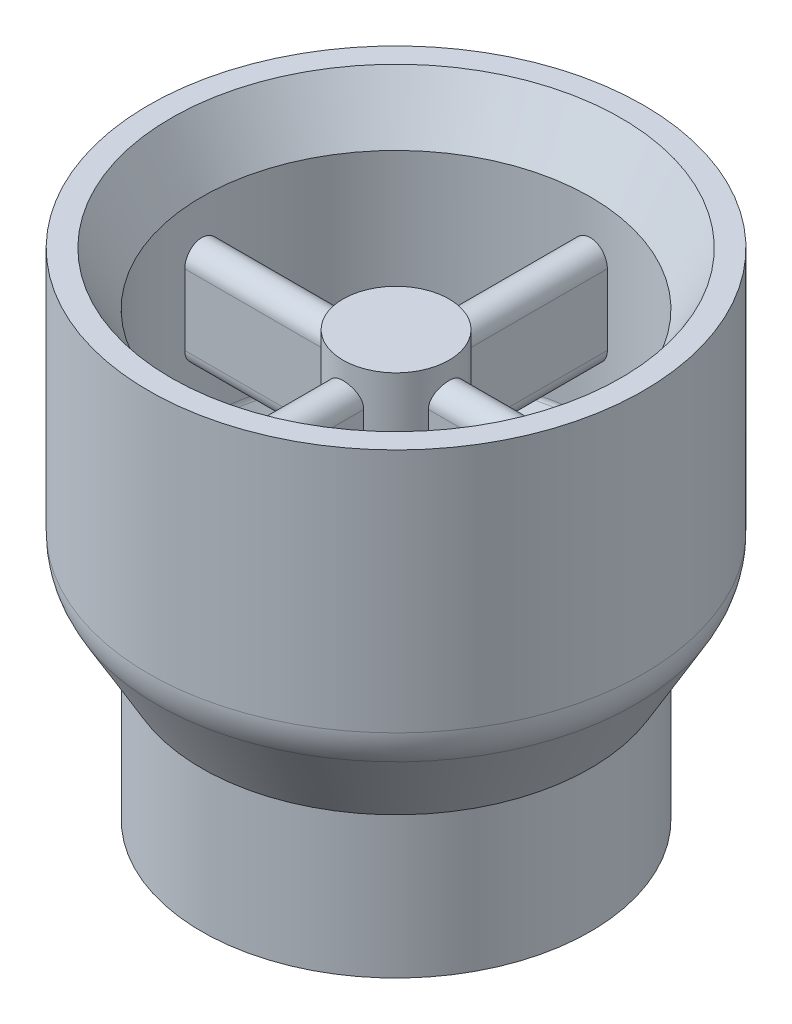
ISO-10303-21;
HEADER;
FILE_DESCRIPTION(('STEP AP214'),'2;1');
FILE_NAME('part.step','',(''),(''),'','','');
FILE_SCHEMA(('AUTOMOTIVE_DESIGN { 1 0 10303 214 1 1 1 1 }'));
ENDSEC;
DATA;
#1=APPLICATION_CONTEXT('core data for automotive mechanical design processes');
#2=APPLICATION_PROTOCOL_DEFINITION('international standard','automotive_design',2000,#1);
#3=PRODUCT_CONTEXT('',#1,'mechanical');
#4=PRODUCT('Part','Part','',(#3));
#5=PRODUCT_RELATED_PRODUCT_CATEGORY('part','',(#4));
#6=PRODUCT_DEFINITION_FORMATION('','',#4);
#7=PRODUCT_DEFINITION_CONTEXT('part definition',#1,'design');
#8=PRODUCT_DEFINITION('design','',#6,#7);
#9=PRODUCT_DEFINITION_SHAPE('','',#8);
#10=(LENGTH_UNIT() NAMED_UNIT(*) SI_UNIT(.MILLI.,.METRE.));
#11=(NAMED_UNIT(*) PLANE_ANGLE_UNIT() SI_UNIT($,.RADIAN.));
#12=(NAMED_UNIT(*) SI_UNIT($,.STERADIAN.) SOLID_ANGLE_UNIT());
#13=UNCERTAINTY_MEASURE_WITH_UNIT(LENGTH_MEASURE(1.E-05),#10,'distance_accuracy_value','');
#14=(GEOMETRIC_REPRESENTATION_CONTEXT(3) GLOBAL_UNCERTAINTY_ASSIGNED_CONTEXT((#13)) GLOBAL_UNIT_ASSIGNED_CONTEXT((#10,
#11,#12)) REPRESENTATION_CONTEXT('',''));
#15=CARTESIAN_POINT('',(0.,0.,0.));
#16=DIRECTION('',(0.,0.,1.));
#17=DIRECTION('',(1.,0.,0.));
#18=AXIS2_PLACEMENT_3D('',#15,#16,#17);
#19=CARTESIAN_POINT('',(-8.98025612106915,-31.75,0.));
#20=DIRECTION('',(-1.,0.,0.));
#21=DIRECTION('',(0.,0.,1.));
#22=AXIS2_PLACEMENT_3D('',#19,#20,#21);
#23=CYLINDRICAL_SURFACE('',#22,3.17499999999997);
#24=DIRECTION('',(1.,0.,0.));
#25=VECTOR('',#24,1.);
#26=CARTESIAN_POINT('',(-8.98025612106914,-31.75,-3.17500000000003));
#27=LINE('',#26,#25);
#28=CARTESIAN_POINT('',(-8.98025612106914,-31.75,-3.17500000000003));
#29=VERTEX_POINT('',#28);
#30=CARTESIAN_POINT('',(-34.780382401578,-31.7500000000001,-3.17500000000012));
#31=VERTEX_POINT('',#30);
#32=EDGE_CURVE('E258',#29,#31,#27,.F.);
#33=ORIENTED_EDGE('',*,*,#32,.F.);
#34=CARTESIAN_POINT('',(-8.98025612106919,-31.75,3.17499999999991));
#35=CARTESIAN_POINT('',(-8.98024230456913,-31.8366229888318,3.17501141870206));
#36=CARTESIAN_POINT('',(-8.98150913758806,-31.9232382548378,3.17145526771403));
#37=CARTESIAN_POINT('',(-8.98650125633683,-32.0957969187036,3.15729678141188));
#38=CARTESIAN_POINT('',(-8.99022587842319,-32.1817404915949,3.14669634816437));
#39=CARTESIAN_POINT('',(-9.00001635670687,-32.3520949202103,3.1185797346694));
#40=CARTESIAN_POINT('',(-9.00607526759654,-32.4365095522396,3.10108406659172));
#41=CARTESIAN_POINT('',(-9.02033527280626,-32.6034505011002,3.05935609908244));
#42=CARTESIAN_POINT('',(-9.02853644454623,-32.6859767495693,3.03512355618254));
#43=CARTESIAN_POINT('',(-9.0559882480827,-32.9297812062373,2.95264270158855));
#44=CARTESIAN_POINT('',(-9.07810279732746,-33.0875375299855,2.88456899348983));
#45=CARTESIAN_POINT('',(-9.12745233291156,-33.3894135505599,2.7243758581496));
#46=CARTESIAN_POINT('',(-9.1546904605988,-33.5335247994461,2.63224166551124));
#47=CARTESIAN_POINT('',(-9.2124045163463,-33.8096769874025,2.42269004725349));
#48=CARTESIAN_POINT('',(-9.24296080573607,-33.9411121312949,2.30449481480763));
#49=CARTESIAN_POINT('',(-9.3031897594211,-34.1827067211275,2.04783780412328));
#50=CARTESIAN_POINT('',(-9.33286226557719,-34.2928623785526,1.9093724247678));
#51=CARTESIAN_POINT('',(-9.38891576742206,-34.4915467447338,1.61164171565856));
#52=CARTESIAN_POINT('',(-9.41519063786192,-34.5794359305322,1.45192782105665));
#53=CARTESIAN_POINT('',(-9.46053507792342,-34.7268555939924,1.11896283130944));
#54=CARTESIAN_POINT('',(-9.47960684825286,-34.7863947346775,0.945715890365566));
#55=CARTESIAN_POINT('',(-9.50782550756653,-34.8733608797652,0.596993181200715));
#56=CARTESIAN_POINT('',(-9.5172945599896,-34.9018328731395,0.42180457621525));
#57=CARTESIAN_POINT('',(-9.52638456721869,-34.9291792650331,0.0688942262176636));
#58=CARTESIAN_POINT('',(-9.52600786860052,-34.9280607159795,-0.108826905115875));
#59=CARTESIAN_POINT('',(-9.515666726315,-34.896919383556,-0.45435471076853));
#60=CARTESIAN_POINT('',(-9.50607893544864,-34.8680320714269,-0.622276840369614));
#61=CARTESIAN_POINT('',(-9.47886599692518,-34.7840516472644,-0.950734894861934));
#62=CARTESIAN_POINT('',(-9.4612404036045,-34.7289570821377,-1.11127040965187));
#63=CARTESIAN_POINT('',(-9.41945246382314,-34.5934619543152,-1.42288461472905));
#64=CARTESIAN_POINT('',(-9.39520718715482,-34.5127380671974,-1.57381114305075));
#65=CARTESIAN_POINT('',(-9.34270382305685,-34.328545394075,-1.86031043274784));
#66=CARTESIAN_POINT('',(-9.31444464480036,-34.225070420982,-1.9958790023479));
#67=CARTESIAN_POINT('',(-9.25532407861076,-33.9925915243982,-2.25455959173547));
#68=CARTESIAN_POINT('',(-9.22440281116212,-33.8626163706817,-2.37678676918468));
#69=CARTESIAN_POINT('',(-9.16455803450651,-33.5837593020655,-2.59801162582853));
#70=CARTESIAN_POINT('',(-9.13563517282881,-33.4348713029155,-2.69700180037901));
#71=CARTESIAN_POINT('',(-9.08272269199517,-33.1193985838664,-2.87021834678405));
#72=CARTESIAN_POINT('',(-9.05881220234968,-32.9525850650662,-2.94405757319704));
#73=CARTESIAN_POINT('',(-9.02936653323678,-32.6943676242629,-3.03267330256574));
#74=CARTESIAN_POINT('',(-9.02062228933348,-32.606978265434,-3.05851877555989));
#75=CARTESIAN_POINT('',(-9.00554368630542,-32.4301163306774,-3.10263697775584));
#76=CARTESIAN_POINT('',(-8.99920822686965,-32.3406447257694,-3.12091316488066));
#77=CARTESIAN_POINT('',(-8.989590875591,-32.1677947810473,-3.14850521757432));
#78=CARTESIAN_POINT('',(-8.98609952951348,-32.0845255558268,-3.15843785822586));
#79=CARTESIAN_POINT('',(-8.98142776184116,-31.9175071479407,-3.17168561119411));
#80=CARTESIAN_POINT('',(-8.98024435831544,-31.8337587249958,-3.17500926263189));
#81=CARTESIAN_POINT('',(-8.98025612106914,-31.75,-3.17500000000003));
#82=B_SPLINE_CURVE_WITH_KNOTS('',3,(#34,#35,#36,#37,#38,#39,#40,#41,#42,#43,#44,#45,#46,#47,#48,
#49,#50,#51,#52,#53,#54,#55,#56,#57,#58,#59,#60,#61,#62,#63,#64,#65,#66,#67,#68,#69,#70,#71,#72,
#73,#74,#75,#76,#77,#78,#79,#80,#81),.UNSPECIFIED.,.F.,.F.,(4,2,2,2,2,2,2,2,2,2,2,2,2,2,2,2,2,2,
2,2,2,2,2,4),(0.,0.259773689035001,0.519477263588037,0.778414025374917,1.03736014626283,
1.55449291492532,2.07194378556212,2.60766387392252,3.14347925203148,3.69327981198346,
4.24291225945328,4.77342553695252,5.30381237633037,5.81339512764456,6.32300613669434,
6.83932018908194,7.35577482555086,7.89650105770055,8.4374016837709,8.98628729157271,
9.26063415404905,9.53485554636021,9.78636405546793,10.0375473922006),.UNSPECIFIED.);
#83=CARTESIAN_POINT('',(-8.98025612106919,-31.75,3.17499999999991));
#84=VERTEX_POINT('',#83);
#85=EDGE_CURVE('E46',#29,#84,#82,.F.);
#86=ORIENTED_EDGE('',*,*,#85,.T.);
#87=DIRECTION('',(1.,0.,0.));
#88=VECTOR('',#87,1.);
#89=CARTESIAN_POINT('',(-8.98025612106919,-31.75,3.17499999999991));
#90=LINE('',#89,#88);
#91=CARTESIAN_POINT('',(-34.7803824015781,-31.7500000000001,3.17499999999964));
#92=VERTEX_POINT('',#91);
#93=EDGE_CURVE('E463',#92,#84,#90,.T.);
#94=ORIENTED_EDGE('',*,*,#93,.F.);
#95=CARTESIAN_POINT('',(-34.780382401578,-31.7500000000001,-3.17500000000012));
#96=CARTESIAN_POINT('',(-34.7803790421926,-31.8391036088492,-3.1750087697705));
#97=CARTESIAN_POINT('',(-34.7807247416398,-31.928202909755,-3.17124912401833));
#98=CARTESIAN_POINT('',(-34.7820894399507,-32.1057604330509,-3.1562609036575));
#99=CARTESIAN_POINT('',(-34.7831083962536,-32.1942186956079,-3.14503280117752));
#100=CARTESIAN_POINT('',(-34.7857936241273,-32.3697964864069,-3.11518857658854));
#101=CARTESIAN_POINT('',(-34.7874593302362,-32.4569171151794,-3.09657890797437));
#102=CARTESIAN_POINT('',(-34.7913875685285,-32.6292530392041,-3.05212536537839));
#103=CARTESIAN_POINT('',(-34.7936500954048,-32.7144683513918,-3.02628155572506));
#104=CARTESIAN_POINT('',(-34.8012445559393,-32.9664209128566,-2.93811820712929));
#105=CARTESIAN_POINT('',(-34.807384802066,-33.1295523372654,-2.86515178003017));
#106=CARTESIAN_POINT('',(-34.82112340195,-33.4411405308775,-2.69302645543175));
#107=CARTESIAN_POINT('',(-34.8287215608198,-33.5895992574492,-2.59387105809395));
#108=CARTESIAN_POINT('',(-34.8445458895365,-33.8682028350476,-2.37184165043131));
#109=CARTESIAN_POINT('',(-34.8527736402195,-33.9982990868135,-2.24890666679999));
#110=CARTESIAN_POINT('',(-34.8689164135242,-34.2360502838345,-1.9829293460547));
#111=CARTESIAN_POINT('',(-34.8768313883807,-34.3437018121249,-1.83988395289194));
#112=CARTESIAN_POINT('',(-34.8914715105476,-34.5336664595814,-1.53745383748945));
#113=CARTESIAN_POINT('',(-34.8981946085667,-34.6159361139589,-1.37804170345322));
#114=CARTESIAN_POINT('',(-34.9096755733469,-34.7525167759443,-1.0476047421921));
#115=CARTESIAN_POINT('',(-34.914433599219,-34.8068300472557,-0.87658085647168));
#116=CARTESIAN_POINT('',(-34.9214375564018,-34.8858188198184,-0.528267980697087));
#117=CARTESIAN_POINT('',(-34.9236904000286,-34.9105758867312,-0.35099762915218));
#118=CARTESIAN_POINT('',(-34.9254536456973,-34.9300016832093,0.00519988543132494));
#119=CARTESIAN_POINT('',(-34.9249640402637,-34.924670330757,0.184127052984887));
#120=CARTESIAN_POINT('',(-34.921303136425,-34.8841360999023,0.537995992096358));
#121=CARTESIAN_POINT('',(-34.9181397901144,-34.8490217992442,0.712948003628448));
#122=CARTESIAN_POINT('',(-34.9094962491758,-34.7500563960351,1.05446399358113));
#123=CARTESIAN_POINT('',(-34.9040160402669,-34.6862051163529,1.2210279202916));
#124=CARTESIAN_POINT('',(-34.8913413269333,-34.5314788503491,1.54132436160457));
#125=CARTESIAN_POINT('',(-34.8841442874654,-34.4405638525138,1.69503744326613));
#126=CARTESIAN_POINT('',(-34.8688446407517,-34.2343240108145,1.98504891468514));
#127=CARTESIAN_POINT('',(-34.8607420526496,-34.1189996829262,2.12134767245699));
#128=CARTESIAN_POINT('',(-34.8445074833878,-33.8667346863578,2.37316982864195));
#129=CARTESIAN_POINT('',(-34.8363754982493,-33.7297200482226,2.4886191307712));
#130=CARTESIAN_POINT('',(-34.8210244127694,-33.4381624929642,2.69492576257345));
#131=CARTESIAN_POINT('',(-34.8138055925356,-33.283614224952,2.78577555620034));
#132=CARTESIAN_POINT('',(-34.8010962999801,-32.9613020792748,2.94029941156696));
#133=CARTESIAN_POINT('',(-34.7956071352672,-32.7935283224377,3.00395292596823));
#134=CARTESIAN_POINT('',(-34.7869983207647,-32.4497394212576,3.10207015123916));
#135=CARTESIAN_POINT('',(-34.7838750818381,-32.2737371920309,3.13657808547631));
#136=CARTESIAN_POINT('',(-34.7815328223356,-32.0387614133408,3.16237470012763));
#137=CARTESIAN_POINT('',(-34.7811016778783,-31.9810605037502,3.1671115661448));
#138=CARTESIAN_POINT('',(-34.7805268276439,-31.8655810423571,3.17341993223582));
#139=CARTESIAN_POINT('',(-34.7803826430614,-31.807802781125,3.17499670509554));
#140=CARTESIAN_POINT('',(-34.7803824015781,-31.7500000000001,3.17499999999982));
#141=B_SPLINE_CURVE_WITH_KNOTS('',3,(#95,#96,#97,#98,#99,#100,#101,#102,#103,#104,#105,#106,
#107,#108,#109,#110,#111,#112,#113,#114,#115,#116,#117,#118,#119,#120,#121,#122,#123,#124,#125,
#126,#127,#128,#129,#130,#131,#132,#133,#134,#135,#136,#137,#138,#139,#140),.UNSPECIFIED.,.F.,
.F.,(4,2,2,2,2,2,2,2,2,2,2,2,2,2,2,2,2,2,2,2,2,2,4),(0.,0.267223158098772,0.534429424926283,
0.801402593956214,1.06837338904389,1.60205183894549,2.13565899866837,2.67065296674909,
3.20572832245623,3.74171493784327,4.27765814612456,4.81211887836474,5.34658106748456,
5.87945925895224,6.41234073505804,6.94601397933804,7.47967594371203,8.01519867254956,
8.55088527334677,9.08697588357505,9.6222516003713,9.79587920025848,9.96921685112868),.UNSPECIFIED.);
#142=EDGE_CURVE('E11',#92,#31,#141,.F.);
#143=ORIENTED_EDGE('',*,*,#142,.T.);
#144=EDGE_LOOP('',(#33,#86,#94,#143));
#145=FACE_BOUND('',#144,.T.);
#146=ADVANCED_FACE('F34',(#145),#23,.T.);
#147=CARTESIAN_POINT('',(0.,-31.75,8.98025612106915));
#148=DIRECTION('',(0.,0.,1.));
#149=DIRECTION('',(1.,0.,0.));
#150=AXIS2_PLACEMENT_3D('',#147,#148,#149);
#151=CYLINDRICAL_SURFACE('',#150,3.175);
#152=DIRECTION('',(0.,0.,-1.));
#153=VECTOR('',#152,1.);
#154=CARTESIAN_POINT('',(-3.175,-31.75,8.98025612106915));
#155=LINE('',#154,#153);
#156=CARTESIAN_POINT('',(-3.175,-31.75,8.98025612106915));
#157=VERTEX_POINT('',#156);
#158=CARTESIAN_POINT('',(-3.175,-31.75,34.780382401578));
#159=VERTEX_POINT('',#158);
#160=EDGE_CURVE('E702',#157,#159,#155,.F.);
#161=ORIENTED_EDGE('',*,*,#160,.F.);
#162=CARTESIAN_POINT('',(3.175,-31.75,8.98025612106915));
#163=CARTESIAN_POINT('',(3.17501141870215,-31.8366229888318,8.9802423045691));
#164=CARTESIAN_POINT('',(3.17145526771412,-31.9232382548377,8.98150913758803));
#165=CARTESIAN_POINT('',(3.15729678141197,-32.0957969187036,8.9865012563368));
#166=CARTESIAN_POINT('',(3.14669634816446,-32.1817404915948,8.99022587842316));
#167=CARTESIAN_POINT('',(3.1185797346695,-32.3520949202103,9.00001635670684));
#168=CARTESIAN_POINT('',(3.10108406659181,-32.4365095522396,9.0060752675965));
#169=CARTESIAN_POINT('',(3.05935609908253,-32.6034505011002,9.02033527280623));
#170=CARTESIAN_POINT('',(3.03512355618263,-32.6859767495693,9.0285364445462));
#171=CARTESIAN_POINT('',(2.95264270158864,-32.9297812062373,9.05598824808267));
#172=CARTESIAN_POINT('',(2.88456899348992,-33.0875375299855,9.07810279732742));
#173=CARTESIAN_POINT('',(2.72437585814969,-33.3894135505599,9.12745233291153));
#174=CARTESIAN_POINT('',(2.63224166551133,-33.5335247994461,9.15469046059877));
#175=CARTESIAN_POINT('',(2.42269004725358,-33.8096769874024,9.21240451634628));
#176=CARTESIAN_POINT('',(2.30449481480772,-33.9411121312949,9.24296080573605));
#177=CARTESIAN_POINT('',(2.04783780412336,-34.1827067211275,9.30318975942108));
#178=CARTESIAN_POINT('',(1.90937242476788,-34.2928623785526,9.33286226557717));
#179=CARTESIAN_POINT('',(1.61164171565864,-34.4915467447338,9.38891576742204));
#180=CARTESIAN_POINT('',(1.45192782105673,-34.5794359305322,9.41519063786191));
#181=CARTESIAN_POINT('',(1.11896283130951,-34.7268555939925,9.46053507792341));
#182=CARTESIAN_POINT('',(0.945715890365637,-34.7863947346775,9.47960684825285));
#183=CARTESIAN_POINT('',(0.596993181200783,-34.8733608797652,9.50782550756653));
#184=CARTESIAN_POINT('',(0.421804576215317,-34.9018328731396,9.5172945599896));
#185=CARTESIAN_POINT('',(0.068894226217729,-34.9291792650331,9.52638456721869));
#186=CARTESIAN_POINT('',(-0.10882690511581,-34.9280607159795,9.52600786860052));
#187=CARTESIAN_POINT('',(-0.454354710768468,-34.8969193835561,9.51566672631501));
#188=CARTESIAN_POINT('',(-0.622276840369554,-34.8680320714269,9.50607893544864));
#189=CARTESIAN_POINT('',(-0.950734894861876,-34.7840516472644,9.47886599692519));
#190=CARTESIAN_POINT('',(-1.11127040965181,-34.7289570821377,9.46124040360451));
#191=CARTESIAN_POINT('',(-1.422884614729,-34.5934619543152,9.41945246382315));
#192=CARTESIAN_POINT('',(-1.5738111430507,-34.5127380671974,9.39520718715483));
#193=CARTESIAN_POINT('',(-1.86031043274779,-34.328545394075,9.34270382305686));
#194=CARTESIAN_POINT('',(-1.99587900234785,-34.225070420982,9.31444464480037));
#195=CARTESIAN_POINT('',(-2.25455959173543,-33.9925915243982,9.25532407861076));
#196=CARTESIAN_POINT('',(-2.37678676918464,-33.8626163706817,9.22440281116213));
#197=CARTESIAN_POINT('',(-2.59801162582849,-33.5837593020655,9.16455803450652));
#198=CARTESIAN_POINT('',(-2.69700180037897,-33.4348713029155,9.13563517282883));
#199=CARTESIAN_POINT('',(-2.87021834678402,-33.1193985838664,9.08272269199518));
#200=CARTESIAN_POINT('',(-2.94405757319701,-32.9525850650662,9.05881220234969));
#201=CARTESIAN_POINT('',(-3.0326733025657,-32.6943676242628,9.02936653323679));
#202=CARTESIAN_POINT('',(-3.05851877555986,-32.606978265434,9.02062228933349));
#203=CARTESIAN_POINT('',(-3.10263697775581,-32.4301163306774,9.00554368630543));
#204=CARTESIAN_POINT('',(-3.12091316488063,-32.3406447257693,8.99920822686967));
#205=CARTESIAN_POINT('',(-3.14850521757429,-32.1677947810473,8.98959087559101));
#206=CARTESIAN_POINT('',(-3.15843785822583,-32.0845255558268,8.9860995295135));
#207=CARTESIAN_POINT('',(-3.17168561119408,-31.9175071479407,8.98142776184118));
#208=CARTESIAN_POINT('',(-3.17500926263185,-31.8337587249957,8.98024435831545));
#209=CARTESIAN_POINT('',(-3.175,-31.75,8.98025612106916));
#210=B_SPLINE_CURVE_WITH_KNOTS('',3,(#162,#163,#164,#165,#166,#167,#168,#169,#170,#171,#172,
#173,#174,#175,#176,#177,#178,#179,#180,#181,#182,#183,#184,#185,#186,#187,#188,#189,#190,#191,
#192,#193,#194,#195,#196,#197,#198,#199,#200,#201,#202,#203,#204,#205,#206,#207,#208,#209),
.UNSPECIFIED.,.F.,.F.,(4,2,2,2,2,2,2,2,2,2,2,2,2,2,2,2,2,2,2,2,2,2,2,4),(0.,0.259773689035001,
0.519477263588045,0.778414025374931,1.03736014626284,1.55449291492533,2.07194378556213,
2.60766387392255,3.14347925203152,3.6932798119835,4.24291225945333,4.77342553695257,
5.30381237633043,5.81339512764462,6.3230061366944,6.83932018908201,7.35577482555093,
7.89650105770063,8.43740168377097,8.9862872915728,9.26063415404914,9.53485554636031,
9.78636405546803,10.0375473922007),.UNSPECIFIED.);
#211=CARTESIAN_POINT('',(3.175,-31.75,8.98025612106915));
#212=VERTEX_POINT('',#211);
#213=EDGE_CURVE('E259',#157,#212,#210,.F.);
#214=ORIENTED_EDGE('',*,*,#213,.T.);
#215=DIRECTION('',(0.,0.,-1.));
#216=VECTOR('',#215,1.);
#217=CARTESIAN_POINT('',(3.175,-31.75,8.98025612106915));
#218=LINE('',#217,#216);
#219=CARTESIAN_POINT('',(3.175,-31.75,34.780382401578));
#220=VERTEX_POINT('',#219);
#221=EDGE_CURVE('E475',#220,#212,#218,.T.);
#222=ORIENTED_EDGE('',*,*,#221,.F.);
#223=CARTESIAN_POINT('',(-3.175,-31.75,34.780382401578));
#224=CARTESIAN_POINT('',(-3.17500876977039,-31.8391036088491,34.7803790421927));
#225=CARTESIAN_POINT('',(-3.17124912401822,-31.9282029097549,34.7807247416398));
#226=CARTESIAN_POINT('',(-3.15626090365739,-32.1057604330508,34.7820894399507));
#227=CARTESIAN_POINT('',(-3.14503280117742,-32.1942186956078,34.7831083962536));
#228=CARTESIAN_POINT('',(-3.11518857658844,-32.3697964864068,34.7857936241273));
#229=CARTESIAN_POINT('',(-3.09657890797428,-32.4569171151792,34.7874593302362));
#230=CARTESIAN_POINT('',(-3.0521253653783,-32.6292530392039,34.7913875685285));
#231=CARTESIAN_POINT('',(-3.02628155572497,-32.7144683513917,34.7936500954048));
#232=CARTESIAN_POINT('',(-2.9381182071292,-32.9664209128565,34.8012445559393));
#233=CARTESIAN_POINT('',(-2.86515178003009,-33.1295523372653,34.8073848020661));
#234=CARTESIAN_POINT('',(-2.69302645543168,-33.4411405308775,34.82112340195));
#235=CARTESIAN_POINT('',(-2.59387105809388,-33.5895992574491,34.8287215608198));
#236=CARTESIAN_POINT('',(-2.37184165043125,-33.8682028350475,34.8445458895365));
#237=CARTESIAN_POINT('',(-2.24890666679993,-33.9982990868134,34.8527736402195));
#238=CARTESIAN_POINT('',(-1.98292934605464,-34.2360502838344,34.8689164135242));
#239=CARTESIAN_POINT('',(-1.83988395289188,-34.3437018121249,34.8768313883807));
#240=CARTESIAN_POINT('',(-1.53745383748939,-34.5336664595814,34.8914715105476));
#241=CARTESIAN_POINT('',(-1.37804170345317,-34.6159361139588,34.8981946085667));
#242=CARTESIAN_POINT('',(-1.04760474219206,-34.7525167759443,34.9096755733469));
#243=CARTESIAN_POINT('',(-0.876580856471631,-34.8068300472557,34.914433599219));
#244=CARTESIAN_POINT('',(-0.528267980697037,-34.8858188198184,34.9214375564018));
#245=CARTESIAN_POINT('',(-0.350997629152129,-34.9105758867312,34.9236904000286));
#246=CARTESIAN_POINT('',(0.00519988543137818,-34.9300016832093,34.9254536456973));
#247=CARTESIAN_POINT('',(0.184127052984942,-34.9246703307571,34.9249640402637));
#248=CARTESIAN_POINT('',(0.537995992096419,-34.8841360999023,34.921303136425));
#249=CARTESIAN_POINT('',(0.712948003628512,-34.8490217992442,34.9181397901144));
#250=CARTESIAN_POINT('',(1.0544639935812,-34.7500563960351,34.9094962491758));
#251=CARTESIAN_POINT('',(1.22102792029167,-34.686205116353,34.9040160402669));
#252=CARTESIAN_POINT('',(1.54132436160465,-34.5314788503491,34.8913413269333));
#253=CARTESIAN_POINT('',(1.69503744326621,-34.4405638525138,34.8841442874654));
#254=CARTESIAN_POINT('',(1.98504891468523,-34.2343240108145,34.8688446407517));
#255=CARTESIAN_POINT('',(2.12134767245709,-34.1189996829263,34.8607420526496));
#256=CARTESIAN_POINT('',(2.37316982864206,-33.8667346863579,34.8445074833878));
#257=CARTESIAN_POINT('',(2.48861913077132,-33.7297200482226,34.8363754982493));
#258=CARTESIAN_POINT('',(2.69492576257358,-33.4381624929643,34.8210244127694));
#259=CARTESIAN_POINT('',(2.78577555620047,-33.2836142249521,34.8138055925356));
#260=CARTESIAN_POINT('',(2.9402994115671,-32.9613020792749,34.8010962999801));
#261=CARTESIAN_POINT('',(3.00395292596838,-32.7935283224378,34.7956071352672));
#262=CARTESIAN_POINT('',(3.10207015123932,-32.4497394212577,34.7869983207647));
#263=CARTESIAN_POINT('',(3.13657808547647,-32.2737371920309,34.7838750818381));
#264=CARTESIAN_POINT('',(3.1623747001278,-32.0387614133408,34.7815328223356));
#265=CARTESIAN_POINT('',(3.16711156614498,-31.9810605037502,34.7811016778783));
#266=CARTESIAN_POINT('',(3.173419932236,-31.865581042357,34.7805268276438));
#267=CARTESIAN_POINT('',(3.17499670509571,-31.8078027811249,34.7803826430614));
#268=CARTESIAN_POINT('',(3.175,-31.75,34.780382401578));
#269=B_SPLINE_CURVE_WITH_KNOTS('',3,(#223,#224,#225,#226,#227,#228,#229,#230,#231,#232,#233,
#234,#235,#236,#237,#238,#239,#240,#241,#242,#243,#244,#245,#246,#247,#248,#249,#250,#251,#252,
#253,#254,#255,#256,#257,#258,#259,#260,#261,#262,#263,#264,#265,#266,#267,#268),.UNSPECIFIED.,
.F.,.F.,(4,2,2,2,2,2,2,2,2,2,2,2,2,2,2,2,2,2,2,2,2,2,4),(0.,0.267223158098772,0.534429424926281,
0.801402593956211,1.0683733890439,1.60205183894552,2.1356589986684,2.67065296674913,
3.20572832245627,3.74171493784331,4.27765814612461,4.8121188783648,5.34658106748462,
5.8794592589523,6.41234073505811,6.94601397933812,7.47967594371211,8.01519867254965,
8.55088527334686,9.08697588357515,9.6222516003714,9.79587920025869,9.96921685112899),.UNSPECIFIED.);
#270=EDGE_CURVE('E252',#220,#159,#269,.F.);
#271=ORIENTED_EDGE('',*,*,#270,.T.);
#272=EDGE_LOOP('',(#161,#214,#222,#271));
#273=FACE_BOUND('',#272,.T.);
#274=ADVANCED_FACE('F265',(#273),#151,.T.);
#275=CARTESIAN_POINT('',(8.98025612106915,-31.75,0.));
#276=DIRECTION('',(1.,0.,0.));
#277=DIRECTION('',(0.,0.,-1.));
#278=AXIS2_PLACEMENT_3D('',#275,#276,#277);
#279=CYLINDRICAL_SURFACE('',#278,3.175);
#280=DIRECTION('',(-1.,0.,0.));
#281=VECTOR('',#280,1.);
#282=CARTESIAN_POINT('',(8.98025612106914,-31.75,3.17500000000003));
#283=LINE('',#282,#281);
#284=CARTESIAN_POINT('',(8.98025612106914,-31.75,3.17500000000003));
#285=VERTEX_POINT('',#284);
#286=CARTESIAN_POINT('',(34.780382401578,-31.75,3.17500000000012));
#287=VERTEX_POINT('',#286);
#288=EDGE_CURVE('E319',#285,#287,#283,.F.);
#289=ORIENTED_EDGE('',*,*,#288,.F.);
#290=CARTESIAN_POINT('',(8.98025612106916,-31.75,-3.17499999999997));
#291=CARTESIAN_POINT('',(8.98024230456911,-31.8366229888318,-3.17501141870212));
#292=CARTESIAN_POINT('',(8.98150913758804,-31.9232382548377,-3.17145526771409));
#293=CARTESIAN_POINT('',(8.98650125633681,-32.0957969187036,-3.15729678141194));
#294=CARTESIAN_POINT('',(8.99022587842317,-32.1817404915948,-3.14669634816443));
#295=CARTESIAN_POINT('',(9.00001635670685,-32.3520949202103,-3.11857973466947));
#296=CARTESIAN_POINT('',(9.00607526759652,-32.4365095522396,-3.10108406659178));
#297=CARTESIAN_POINT('',(9.02033527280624,-32.6034505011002,-3.0593560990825));
#298=CARTESIAN_POINT('',(9.02853644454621,-32.6859767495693,-3.0351235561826));
#299=CARTESIAN_POINT('',(9.05598824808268,-32.9297812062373,-2.95264270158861));
#300=CARTESIAN_POINT('',(9.07810279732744,-33.0875375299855,-2.88456899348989));
#301=CARTESIAN_POINT('',(9.12745233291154,-33.3894135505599,-2.72437585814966));
#302=CARTESIAN_POINT('',(9.15469046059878,-33.5335247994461,-2.6322416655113));
#303=CARTESIAN_POINT('',(9.21240451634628,-33.8096769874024,-2.42269004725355));
#304=CARTESIAN_POINT('',(9.24296080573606,-33.9411121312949,-2.30449481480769));
#305=CARTESIAN_POINT('',(9.30318975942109,-34.1827067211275,-2.04783780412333));
#306=CARTESIAN_POINT('',(9.33286226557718,-34.2928623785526,-1.90937242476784));
#307=CARTESIAN_POINT('',(9.38891576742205,-34.4915467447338,-1.6116417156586));
#308=CARTESIAN_POINT('',(9.41519063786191,-34.5794359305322,-1.4519278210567));
#309=CARTESIAN_POINT('',(9.46053507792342,-34.7268555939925,-1.11896283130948));
#310=CARTESIAN_POINT('',(9.47960684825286,-34.7863947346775,-0.945715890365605));
#311=CARTESIAN_POINT('',(9.50782550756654,-34.8733608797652,-0.596993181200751));
#312=CARTESIAN_POINT('',(9.5172945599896,-34.9018328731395,-0.421804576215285));
#313=CARTESIAN_POINT('',(9.52638456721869,-34.9291792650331,-0.0688942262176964));
#314=CARTESIAN_POINT('',(9.52600786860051,-34.9280607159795,0.108826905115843));
#315=CARTESIAN_POINT('',(9.515666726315,-34.8969193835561,0.4543547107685));
#316=CARTESIAN_POINT('',(9.50607893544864,-34.8680320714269,0.622276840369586));
#317=CARTESIAN_POINT('',(9.47886599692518,-34.7840516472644,0.950734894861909));
#318=CARTESIAN_POINT('',(9.4612404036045,-34.7289570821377,1.11127040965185));
#319=CARTESIAN_POINT('',(9.41945246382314,-34.5934619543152,1.42288461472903));
#320=CARTESIAN_POINT('',(9.39520718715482,-34.5127380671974,1.57381114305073));
#321=CARTESIAN_POINT('',(9.34270382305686,-34.328545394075,1.86031043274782));
#322=CARTESIAN_POINT('',(9.31444464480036,-34.225070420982,1.99587900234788));
#323=CARTESIAN_POINT('',(9.25532407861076,-33.9925915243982,2.25455959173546));
#324=CARTESIAN_POINT('',(9.22440281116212,-33.8626163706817,2.37678676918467));
#325=CARTESIAN_POINT('',(9.16455803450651,-33.5837593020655,2.59801162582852));
#326=CARTESIAN_POINT('',(9.13563517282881,-33.4348713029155,2.697001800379));
#327=CARTESIAN_POINT('',(9.08272269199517,-33.1193985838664,2.87021834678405));
#328=CARTESIAN_POINT('',(9.05881220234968,-32.9525850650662,2.94405757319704));
#329=CARTESIAN_POINT('',(9.02936653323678,-32.6943676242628,3.03267330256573));
#330=CARTESIAN_POINT('',(9.02062228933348,-32.606978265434,3.05851877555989));
#331=CARTESIAN_POINT('',(9.00554368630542,-32.4301163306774,3.10263697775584));
#332=CARTESIAN_POINT('',(8.99920822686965,-32.3406447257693,3.12091316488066));
#333=CARTESIAN_POINT('',(8.989590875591,-32.1677947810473,3.14850521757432));
#334=CARTESIAN_POINT('',(8.98609952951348,-32.0845255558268,3.15843785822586));
#335=CARTESIAN_POINT('',(8.98142776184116,-31.9175071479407,3.17168561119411));
#336=CARTESIAN_POINT('',(8.98024435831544,-31.8337587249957,3.17500926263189));
#337=CARTESIAN_POINT('',(8.98025612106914,-31.75,3.17500000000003));
#338=B_SPLINE_CURVE_WITH_KNOTS('',3,(#290,#291,#292,#293,#294,#295,#296,#297,#298,#299,#300,
#301,#302,#303,#304,#305,#306,#307,#308,#309,#310,#311,#312,#313,#314,#315,#316,#317,#318,#319,
#320,#321,#322,#323,#324,#325,#326,#327,#328,#329,#330,#331,#332,#333,#334,#335,#336,#337),
.UNSPECIFIED.,.F.,.F.,(4,2,2,2,2,2,2,2,2,2,2,2,2,2,2,2,2,2,2,2,2,2,2,4),(0.,0.259773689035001,
0.519477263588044,0.778414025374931,1.03736014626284,1.55449291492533,2.07194378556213,
2.60766387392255,3.14347925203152,3.6932798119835,4.24291225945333,4.77342553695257,
5.30381237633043,5.81339512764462,6.3230061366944,6.83932018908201,7.35577482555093,
7.89650105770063,8.43740168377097,8.9862872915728,9.26063415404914,9.53485554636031,
9.78636405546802,10.0375473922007),.UNSPECIFIED.);
#339=CARTESIAN_POINT('',(8.98025612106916,-31.75,-3.17499999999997));
#340=VERTEX_POINT('',#339);
#341=EDGE_CURVE('E277',#285,#340,#338,.F.);
#342=ORIENTED_EDGE('',*,*,#341,.T.);
#343=DIRECTION('',(-1.,0.,0.));
#344=VECTOR('',#343,1.);
#345=CARTESIAN_POINT('',(8.98025612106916,-31.75,-3.17499999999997));
#346=LINE('',#345,#344);
#347=CARTESIAN_POINT('',(34.780382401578,-31.75,-3.17499999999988));
#348=VERTEX_POINT('',#347);
#349=EDGE_CURVE('E282',#348,#340,#346,.T.);
#350=ORIENTED_EDGE('',*,*,#349,.F.);
#351=CARTESIAN_POINT('',(34.780382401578,-31.75,3.17500000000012));
#352=CARTESIAN_POINT('',(34.7803790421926,-31.8391036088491,3.17500876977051));
#353=CARTESIAN_POINT('',(34.7807247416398,-31.9282029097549,3.17124912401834));
#354=CARTESIAN_POINT('',(34.7820894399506,-32.1057604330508,3.15626090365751));
#355=CARTESIAN_POINT('',(34.7831083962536,-32.1942186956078,3.14503280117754));
#356=CARTESIAN_POINT('',(34.7857936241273,-32.3697964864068,3.11518857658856));
#357=CARTESIAN_POINT('',(34.7874593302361,-32.4569171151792,3.0965789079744));
#358=CARTESIAN_POINT('',(34.7913875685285,-32.6292530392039,3.05212536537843));
#359=CARTESIAN_POINT('',(34.7936500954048,-32.7144683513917,3.02628155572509));
#360=CARTESIAN_POINT('',(34.8012445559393,-32.9664209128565,2.93811820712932));
#361=CARTESIAN_POINT('',(34.807384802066,-33.1295523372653,2.86515178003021));
#362=CARTESIAN_POINT('',(34.82112340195,-33.4411405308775,2.6930264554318));
#363=CARTESIAN_POINT('',(34.8287215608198,-33.5895992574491,2.593871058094));
#364=CARTESIAN_POINT('',(34.8445458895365,-33.8682028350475,2.37184165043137));
#365=CARTESIAN_POINT('',(34.8527736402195,-33.9982990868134,2.24890666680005));
#366=CARTESIAN_POINT('',(34.8689164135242,-34.2360502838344,1.98292934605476));
#367=CARTESIAN_POINT('',(34.8768313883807,-34.3437018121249,1.839883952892));
#368=CARTESIAN_POINT('',(34.8914715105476,-34.5336664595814,1.53745383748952));
#369=CARTESIAN_POINT('',(34.8981946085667,-34.6159361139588,1.37804170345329));
#370=CARTESIAN_POINT('',(34.9096755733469,-34.7525167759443,1.04760474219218));
#371=CARTESIAN_POINT('',(34.914433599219,-34.8068300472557,0.876580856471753));
#372=CARTESIAN_POINT('',(34.9214375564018,-34.8858188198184,0.528267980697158));
#373=CARTESIAN_POINT('',(34.9236904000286,-34.9105758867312,0.35099762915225));
#374=CARTESIAN_POINT('',(34.9254536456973,-34.9300016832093,-0.00519988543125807));
#375=CARTESIAN_POINT('',(34.9249640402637,-34.9246703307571,-0.184127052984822));
#376=CARTESIAN_POINT('',(34.921303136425,-34.8841360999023,-0.537995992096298));
#377=CARTESIAN_POINT('',(34.9181397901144,-34.8490217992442,-0.712948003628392));
#378=CARTESIAN_POINT('',(34.9094962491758,-34.7500563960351,-1.05446399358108));
#379=CARTESIAN_POINT('',(34.9040160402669,-34.686205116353,-1.22102792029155));
#380=CARTESIAN_POINT('',(34.8913413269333,-34.5314788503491,-1.54132436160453));
#381=CARTESIAN_POINT('',(34.8841442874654,-34.4405638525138,-1.69503744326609));
#382=CARTESIAN_POINT('',(34.8688446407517,-34.2343240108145,-1.98504891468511));
#383=CARTESIAN_POINT('',(34.8607420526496,-34.1189996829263,-2.12134767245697));
#384=CARTESIAN_POINT('',(34.8445074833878,-33.8667346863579,-2.37316982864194));
#385=CARTESIAN_POINT('',(34.8363754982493,-33.7297200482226,-2.4886191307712));
#386=CARTESIAN_POINT('',(34.8210244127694,-33.4381624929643,-2.69492576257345));
#387=CARTESIAN_POINT('',(34.8138055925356,-33.2836142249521,-2.78577555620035));
#388=CARTESIAN_POINT('',(34.8010962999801,-32.9613020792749,-2.94029941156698));
#389=CARTESIAN_POINT('',(34.7956071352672,-32.7935283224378,-3.00395292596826));
#390=CARTESIAN_POINT('',(34.7869983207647,-32.4497394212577,-3.1020701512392));
#391=CARTESIAN_POINT('',(34.7838750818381,-32.2737371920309,-3.13657808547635));
#392=CARTESIAN_POINT('',(34.7815328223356,-32.0387614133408,-3.16237470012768));
#393=CARTESIAN_POINT('',(34.7811016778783,-31.9810605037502,-3.16711156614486));
#394=CARTESIAN_POINT('',(34.7805268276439,-31.865581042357,-3.17341993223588));
#395=CARTESIAN_POINT('',(34.7803826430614,-31.8078027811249,-3.17499670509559));
#396=CARTESIAN_POINT('',(34.7803824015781,-31.75,-3.17499999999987));
#397=B_SPLINE_CURVE_WITH_KNOTS('',3,(#351,#352,#353,#354,#355,#356,#357,#358,#359,#360,#361,
#362,#363,#364,#365,#366,#367,#368,#369,#370,#371,#372,#373,#374,#375,#376,#377,#378,#379,#380,
#381,#382,#383,#384,#385,#386,#387,#388,#389,#390,#391,#392,#393,#394,#395,#396),.UNSPECIFIED.,
.F.,.F.,(4,2,2,2,2,2,2,2,2,2,2,2,2,2,2,2,2,2,2,2,2,2,4),(0.,0.267223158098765,0.534429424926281,
0.801402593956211,1.0683733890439,1.60205183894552,2.1356589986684,2.67065296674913,
3.20572832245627,3.74171493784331,4.27765814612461,4.8121188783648,5.34658106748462,
5.87945925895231,6.41234073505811,6.94601397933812,7.47967594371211,8.01519867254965,
8.55088527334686,9.08697588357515,9.6222516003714,9.79587920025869,9.96921685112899),.UNSPECIFIED.);
#398=EDGE_CURVE('E244',#348,#287,#397,.F.);
#399=ORIENTED_EDGE('',*,*,#398,.T.);
#400=EDGE_LOOP('',(#289,#342,#350,#399));
#401=FACE_BOUND('',#400,.T.);
#402=ADVANCED_FACE('F268',(#401),#279,.T.);
#403=CARTESIAN_POINT('',(-34.780382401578,-19.0499999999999,-2.38524477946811E-13));
#404=DIRECTION('',(-1.,0.,0.));
#405=DIRECTION('',(0.,0.,1.));
#406=AXIS2_PLACEMENT_3D('',#403,#404,#405);
#407=CYLINDRICAL_SURFACE('',#406,3.17499999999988);
#408=DIRECTION('',(-1.,0.,0.));
#409=VECTOR('',#408,1.);
#410=CARTESIAN_POINT('',(0.,-19.0499999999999,-3.175));
#411=LINE('',#410,#409);
#412=CARTESIAN_POINT('',(-34.780382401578,-19.0499999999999,-3.17500000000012));
#413=VERTEX_POINT('',#412);
#414=CARTESIAN_POINT('',(-8.98025612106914,-19.05,-3.17500000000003));
#415=VERTEX_POINT('',#414);
#416=EDGE_CURVE('E366',#413,#415,#411,.F.);
#417=ORIENTED_EDGE('',*,*,#416,.F.);
#418=CARTESIAN_POINT('',(-34.7803824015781,-19.0499999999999,3.17499999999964));
#419=CARTESIAN_POINT('',(-34.7803790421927,-18.9608963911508,3.17500876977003));
#420=CARTESIAN_POINT('',(-34.7807247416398,-18.871797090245,3.17124912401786));
#421=CARTESIAN_POINT('',(-34.7820894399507,-18.6942395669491,3.15626090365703));
#422=CARTESIAN_POINT('',(-34.7831083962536,-18.6057813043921,3.14503280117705));
#423=CARTESIAN_POINT('',(-34.7857936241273,-18.4302035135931,3.11518857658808));
#424=CARTESIAN_POINT('',(-34.7874593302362,-18.3430828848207,3.09657890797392));
#425=CARTESIAN_POINT('',(-34.7913875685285,-18.170746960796,3.05212536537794));
#426=CARTESIAN_POINT('',(-34.7936500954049,-18.0855316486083,3.02628155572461));
#427=CARTESIAN_POINT('',(-34.8012445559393,-17.8335790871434,2.93811820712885));
#428=CARTESIAN_POINT('',(-34.8073848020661,-17.6704476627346,2.86515178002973));
#429=CARTESIAN_POINT('',(-34.8211234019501,-17.3588594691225,2.69302645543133));
#430=CARTESIAN_POINT('',(-34.8287215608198,-17.2104007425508,2.59387105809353));
#431=CARTESIAN_POINT('',(-34.8445458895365,-16.9317971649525,2.37184165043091));
#432=CARTESIAN_POINT('',(-34.8527736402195,-16.8017009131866,2.24890666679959));
#433=CARTESIAN_POINT('',(-34.8689164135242,-16.5639497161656,1.98292934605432));
#434=CARTESIAN_POINT('',(-34.8768313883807,-16.4562981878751,1.83988395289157));
#435=CARTESIAN_POINT('',(-34.8914715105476,-16.2663335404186,1.53745383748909));
#436=CARTESIAN_POINT('',(-34.8981946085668,-16.1840638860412,1.37804170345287));
#437=CARTESIAN_POINT('',(-34.9096755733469,-16.0474832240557,1.04760474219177));
#438=CARTESIAN_POINT('',(-34.914433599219,-15.9931699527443,0.876580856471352));
#439=CARTESIAN_POINT('',(-34.9214375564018,-15.9141811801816,0.528267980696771));
#440=CARTESIAN_POINT('',(-34.9236904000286,-15.8894241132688,0.350997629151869));
#441=CARTESIAN_POINT('',(-34.9254536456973,-15.8699983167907,-0.00519988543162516));
#442=CARTESIAN_POINT('',(-34.9249640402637,-15.8753296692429,-0.184127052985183));
#443=CARTESIAN_POINT('',(-34.921303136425,-15.9158639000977,-0.537995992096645));
#444=CARTESIAN_POINT('',(-34.9181397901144,-15.9509782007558,-0.712948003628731));
#445=CARTESIAN_POINT('',(-34.9094962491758,-16.0499436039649,-1.0544639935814));
#446=CARTESIAN_POINT('',(-34.9040160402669,-16.113794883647,-1.22102792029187));
#447=CARTESIAN_POINT('',(-34.8913413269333,-16.2685211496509,-1.54132436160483));
#448=CARTESIAN_POINT('',(-34.8841442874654,-16.3594361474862,-1.69503744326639));
#449=CARTESIAN_POINT('',(-34.8688446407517,-16.5656759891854,-1.9850489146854));
#450=CARTESIAN_POINT('',(-34.8607420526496,-16.6810003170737,-2.12134767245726));
#451=CARTESIAN_POINT('',(-34.8445074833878,-16.9332653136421,-2.37316982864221));
#452=CARTESIAN_POINT('',(-34.8363754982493,-17.0702799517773,-2.48861913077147));
#453=CARTESIAN_POINT('',(-34.8210244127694,-17.3618375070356,-2.69492576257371));
#454=CARTESIAN_POINT('',(-34.8138055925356,-17.5163857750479,-2.7857755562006));
#455=CARTESIAN_POINT('',(-34.8010962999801,-17.8386979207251,-2.94029941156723));
#456=CARTESIAN_POINT('',(-34.7956071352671,-18.0064716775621,-3.0039529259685));
#457=CARTESIAN_POINT('',(-34.7869983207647,-18.3502605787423,-3.10207015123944));
#458=CARTESIAN_POINT('',(-34.783875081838,-18.526262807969,-3.13657808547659));
#459=CARTESIAN_POINT('',(-34.7815328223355,-18.7612385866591,-3.16237470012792));
#460=CARTESIAN_POINT('',(-34.7811016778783,-18.8189394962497,-3.1671115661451));
#461=CARTESIAN_POINT('',(-34.7805268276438,-18.9344189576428,-3.17341993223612));
#462=CARTESIAN_POINT('',(-34.7803826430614,-18.992197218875,-3.17499670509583));
#463=CARTESIAN_POINT('',(-34.780382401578,-19.0499999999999,-3.17500000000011));
#464=B_SPLINE_CURVE_WITH_KNOTS('',3,(#418,#419,#420,#421,#422,#423,#424,#425,#426,#427,#428,
#429,#430,#431,#432,#433,#434,#435,#436,#437,#438,#439,#440,#441,#442,#443,#444,#445,#446,#447,
#448,#449,#450,#451,#452,#453,#454,#455,#456,#457,#458,#459,#460,#461,#462,#463),.UNSPECIFIED.,
.F.,.F.,(4,2,2,2,2,2,2,2,2,2,2,2,2,2,2,2,2,2,2,2,2,2,4),(0.,0.267223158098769,0.534429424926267,
0.801402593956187,1.06837338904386,1.60205183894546,2.13565899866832,2.67065296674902,
3.20572832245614,3.74171493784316,4.27765814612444,4.81211887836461,5.34658106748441,
5.87945925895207,6.41234073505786,6.94601397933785,7.47967594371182,8.01519867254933,
8.55088527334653,9.08697588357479,9.62225160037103,9.79587920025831,9.9692168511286),.UNSPECIFIED.);
#465=CARTESIAN_POINT('',(-34.7803824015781,-19.0499999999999,3.17499999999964));
#466=VERTEX_POINT('',#465);
#467=EDGE_CURVE('E236',#413,#466,#464,.F.);
#468=ORIENTED_EDGE('',*,*,#467,.T.);
#469=DIRECTION('',(-1.,0.,0.));
#470=VECTOR('',#469,1.);
#471=CARTESIAN_POINT('',(0.,-19.0499999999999,3.175));
#472=LINE('',#471,#470);
#473=CARTESIAN_POINT('',(-8.98025612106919,-19.05,3.17499999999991));
#474=VERTEX_POINT('',#473);
#475=EDGE_CURVE('E369',#474,#466,#472,.T.);
#476=ORIENTED_EDGE('',*,*,#475,.F.);
#477=CARTESIAN_POINT('',(-8.98025612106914,-19.05,-3.17500000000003));
#478=CARTESIAN_POINT('',(-8.98024230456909,-18.9633770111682,-3.17501141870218));
#479=CARTESIAN_POINT('',(-8.98150913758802,-18.8767617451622,-3.17145526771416));
#480=CARTESIAN_POINT('',(-8.98650125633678,-18.7042030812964,-3.15729678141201));
#481=CARTESIAN_POINT('',(-8.99022587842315,-18.6182595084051,-3.14669634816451));
#482=CARTESIAN_POINT('',(-9.00001635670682,-18.4479050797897,-3.11857973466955));
#483=CARTESIAN_POINT('',(-9.00607526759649,-18.3634904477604,-3.10108406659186));
#484=CARTESIAN_POINT('',(-9.02033527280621,-18.1965494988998,-3.05935609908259));
#485=CARTESIAN_POINT('',(-9.02853644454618,-18.1140232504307,-3.03512355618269));
#486=CARTESIAN_POINT('',(-9.05598824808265,-17.8702187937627,-2.95264270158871));
#487=CARTESIAN_POINT('',(-9.0781027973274,-17.7124624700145,-2.88456899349));
#488=CARTESIAN_POINT('',(-9.1274523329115,-17.4105864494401,-2.72437585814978));
#489=CARTESIAN_POINT('',(-9.15469046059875,-17.2664752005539,-2.63224166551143));
#490=CARTESIAN_POINT('',(-9.21240451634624,-16.9903230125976,-2.4226900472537));
#491=CARTESIAN_POINT('',(-9.24296080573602,-16.8588878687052,-2.30449481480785));
#492=CARTESIAN_POINT('',(-9.30318975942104,-16.6172932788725,-2.04783780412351));
#493=CARTESIAN_POINT('',(-9.33286226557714,-16.5071376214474,-1.90937242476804));
#494=CARTESIAN_POINT('',(-9.38891576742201,-16.3084532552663,-1.61164171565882));
#495=CARTESIAN_POINT('',(-9.41519063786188,-16.2205640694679,-1.45192782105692));
#496=CARTESIAN_POINT('',(-9.46053507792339,-16.0731444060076,-1.11896283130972));
#497=CARTESIAN_POINT('',(-9.47960684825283,-16.0136052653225,-0.945715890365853));
#498=CARTESIAN_POINT('',(-9.50782550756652,-15.9266391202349,-0.596993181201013));
#499=CARTESIAN_POINT('',(-9.51729455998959,-15.8981671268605,-0.421804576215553));
#500=CARTESIAN_POINT('',(-9.52638456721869,-15.8708207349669,-0.0688942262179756));
#501=CARTESIAN_POINT('',(-9.52600786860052,-15.8719392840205,0.108826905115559));
#502=CARTESIAN_POINT('',(-9.51566672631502,-15.9030806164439,0.454354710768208));
#503=CARTESIAN_POINT('',(-9.50607893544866,-15.9319679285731,0.62227684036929));
#504=CARTESIAN_POINT('',(-9.47886599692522,-16.0159483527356,0.950734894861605));
#505=CARTESIAN_POINT('',(-9.46124040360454,-16.0710429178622,1.11127040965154));
#506=CARTESIAN_POINT('',(-9.41945246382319,-16.2065380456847,1.42288461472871));
#507=CARTESIAN_POINT('',(-9.39520718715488,-16.2872619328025,1.57381114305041));
#508=CARTESIAN_POINT('',(-9.34270382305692,-16.4714546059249,1.86031043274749));
#509=CARTESIAN_POINT('',(-9.31444464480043,-16.5749295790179,1.99587900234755));
#510=CARTESIAN_POINT('',(-9.25532407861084,-16.8074084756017,2.25455959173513));
#511=CARTESIAN_POINT('',(-9.22440281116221,-16.9373836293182,2.37678676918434));
#512=CARTESIAN_POINT('',(-9.16455803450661,-17.2162406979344,2.59801162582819));
#513=CARTESIAN_POINT('',(-9.13563517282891,-17.3651286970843,2.69700180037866));
#514=CARTESIAN_POINT('',(-9.08272269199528,-17.6806014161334,2.87021834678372));
#515=CARTESIAN_POINT('',(-9.05881220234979,-17.8474149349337,2.94405757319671));
#516=CARTESIAN_POINT('',(-9.02936653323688,-18.105632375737,3.03267330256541));
#517=CARTESIAN_POINT('',(-9.02062228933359,-18.1930217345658,3.05851877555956));
#518=CARTESIAN_POINT('',(-9.00554368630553,-18.3698836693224,3.10263697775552));
#519=CARTESIAN_POINT('',(-8.99920822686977,-18.4593552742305,3.12091316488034));
#520=CARTESIAN_POINT('',(-8.98959087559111,-18.6322052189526,3.14850521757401));
#521=CARTESIAN_POINT('',(-8.98609952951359,-18.715474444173,3.15843785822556));
#522=CARTESIAN_POINT('',(-8.98142776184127,-18.8824928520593,3.17168561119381));
#523=CARTESIAN_POINT('',(-8.98024435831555,-18.9662412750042,3.17500926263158));
#524=CARTESIAN_POINT('',(-8.98025612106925,-19.05,3.17499999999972));
#525=B_SPLINE_CURVE_WITH_KNOTS('',3,(#477,#478,#479,#480,#481,#482,#483,#484,#485,#486,#487,
#488,#489,#490,#491,#492,#493,#494,#495,#496,#497,#498,#499,#500,#501,#502,#503,#504,#505,#506,
#507,#508,#509,#510,#511,#512,#513,#514,#515,#516,#517,#518,#519,#520,#521,#522,#523,#524),
.UNSPECIFIED.,.F.,.F.,(4,2,2,2,2,2,2,2,2,2,2,2,2,2,2,2,2,2,2,2,2,2,2,4),(0.,0.259773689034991,
0.519477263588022,0.778414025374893,1.0373601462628,1.55449291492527,2.07194378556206,
2.60766387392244,3.14347925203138,3.69327981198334,4.24291225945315,4.77342553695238,
5.30381237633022,5.8133951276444,6.32300613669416,6.83932018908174,7.35577482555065,
7.89650105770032,8.43740168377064,8.98628729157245,9.26063415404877,9.53485554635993,
9.78636405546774,10.0375473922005),.UNSPECIFIED.);
#526=EDGE_CURVE('E315',#474,#415,#525,.F.);
#527=ORIENTED_EDGE('',*,*,#526,.T.);
#528=EDGE_LOOP('',(#417,#468,#476,#527));
#529=FACE_BOUND('',#528,.T.);
#530=ADVANCED_FACE('F273',(#529),#407,.T.);
#531=CARTESIAN_POINT('',(0.,-19.05,34.780382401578));
#532=DIRECTION('',(0.,0.,1.));
#533=DIRECTION('',(1.,0.,0.));
#534=AXIS2_PLACEMENT_3D('',#531,#532,#533);
#535=CYLINDRICAL_SURFACE('',#534,3.175);
#536=DIRECTION('',(0.,0.,1.));
#537=VECTOR('',#536,1.);
#538=CARTESIAN_POINT('',(-3.175,-19.05,0.));
#539=LINE('',#538,#537);
#540=CARTESIAN_POINT('',(-3.175,-19.05,34.780382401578));
#541=VERTEX_POINT('',#540);
#542=CARTESIAN_POINT('',(-3.175,-19.05,8.98025612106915));
#543=VERTEX_POINT('',#542);
#544=EDGE_CURVE('E352',#541,#543,#539,.F.);
#545=ORIENTED_EDGE('',*,*,#544,.F.);
#546=CARTESIAN_POINT('',(3.175,-19.05,34.780382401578));
#547=CARTESIAN_POINT('',(3.17500876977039,-18.9608963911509,34.7803790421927));
#548=CARTESIAN_POINT('',(3.17124912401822,-18.8717970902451,34.7807247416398));
#549=CARTESIAN_POINT('',(3.15626090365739,-18.6942395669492,34.7820894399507));
#550=CARTESIAN_POINT('',(3.14503280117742,-18.6057813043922,34.7831083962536));
#551=CARTESIAN_POINT('',(3.11518857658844,-18.4302035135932,34.7857936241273));
#552=CARTESIAN_POINT('',(3.09657890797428,-18.3430828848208,34.7874593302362));
#553=CARTESIAN_POINT('',(3.0521253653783,-18.170746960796,34.7913875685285));
#554=CARTESIAN_POINT('',(3.02628155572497,-18.0855316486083,34.7936500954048));
#555=CARTESIAN_POINT('',(2.9381182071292,-17.8335790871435,34.8012445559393));
#556=CARTESIAN_POINT('',(2.86515178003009,-17.6704476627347,34.8073848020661));
#557=CARTESIAN_POINT('',(2.69302645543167,-17.3588594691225,34.82112340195));
#558=CARTESIAN_POINT('',(2.59387105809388,-17.2104007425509,34.8287215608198));
#559=CARTESIAN_POINT('',(2.37184165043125,-16.9317971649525,34.8445458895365));
#560=CARTESIAN_POINT('',(2.24890666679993,-16.8017009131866,34.8527736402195));
#561=CARTESIAN_POINT('',(1.98292934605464,-16.5639497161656,34.8689164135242));
#562=CARTESIAN_POINT('',(1.83988395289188,-16.4562981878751,34.8768313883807));
#563=CARTESIAN_POINT('',(1.53745383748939,-16.2663335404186,34.8914715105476));
#564=CARTESIAN_POINT('',(1.37804170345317,-16.1840638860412,34.8981946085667));
#565=CARTESIAN_POINT('',(1.04760474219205,-16.0474832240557,34.9096755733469));
#566=CARTESIAN_POINT('',(0.876580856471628,-15.9931699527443,34.914433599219));
#567=CARTESIAN_POINT('',(0.528267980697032,-15.9141811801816,34.9214375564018));
#568=CARTESIAN_POINT('',(0.350997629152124,-15.8894241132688,34.9236904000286));
#569=CARTESIAN_POINT('',(-0.00519988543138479,-15.8699983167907,34.9254536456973));
#570=CARTESIAN_POINT('',(-0.184127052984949,-15.8753296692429,34.9249640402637));
#571=CARTESIAN_POINT('',(-0.537995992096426,-15.9158639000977,34.921303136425));
#572=CARTESIAN_POINT('',(-0.712948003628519,-15.9509782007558,34.9181397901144));
#573=CARTESIAN_POINT('',(-1.05446399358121,-16.0499436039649,34.9094962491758));
#574=CARTESIAN_POINT('',(-1.22102792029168,-16.113794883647,34.9040160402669));
#575=CARTESIAN_POINT('',(-1.54132436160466,-16.2685211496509,34.8913413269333));
#576=CARTESIAN_POINT('',(-1.69503744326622,-16.3594361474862,34.8841442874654));
#577=CARTESIAN_POINT('',(-1.98504891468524,-16.5656759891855,34.8688446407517));
#578=CARTESIAN_POINT('',(-2.1213476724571,-16.6810003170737,34.8607420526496));
#579=CARTESIAN_POINT('',(-2.37316982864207,-16.9332653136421,34.8445074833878));
#580=CARTESIAN_POINT('',(-2.48861913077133,-17.0702799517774,34.8363754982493));
#581=CARTESIAN_POINT('',(-2.69492576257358,-17.3618375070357,34.8210244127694));
#582=CARTESIAN_POINT('',(-2.78577555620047,-17.5163857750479,34.8138055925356));
#583=CARTESIAN_POINT('',(-2.94029941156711,-17.8386979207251,34.8010962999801));
#584=CARTESIAN_POINT('',(-3.00395292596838,-18.0064716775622,34.7956071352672));
#585=CARTESIAN_POINT('',(-3.10207015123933,-18.3502605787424,34.7869983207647));
#586=CARTESIAN_POINT('',(-3.13657808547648,-18.5262628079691,34.7838750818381));
#587=CARTESIAN_POINT('',(-3.16237470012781,-18.7612385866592,34.7815328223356));
#588=CARTESIAN_POINT('',(-3.16711156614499,-18.8189394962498,34.7811016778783));
#589=CARTESIAN_POINT('',(-3.17341993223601,-18.934418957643,34.7805268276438));
#590=CARTESIAN_POINT('',(-3.17499670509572,-18.9921972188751,34.7803826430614));
#591=CARTESIAN_POINT('',(-3.175,-19.05,34.780382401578));
#592=B_SPLINE_CURVE_WITH_KNOTS('',3,(#546,#547,#548,#549,#550,#551,#552,#553,#554,#555,#556,
#557,#558,#559,#560,#561,#562,#563,#564,#565,#566,#567,#568,#569,#570,#571,#572,#573,#574,#575,
#576,#577,#578,#579,#580,#581,#582,#583,#584,#585,#586,#587,#588,#589,#590,#591),.UNSPECIFIED.,
.F.,.F.,(4,2,2,2,2,2,2,2,2,2,2,2,2,2,2,2,2,2,2,2,2,2,4),(0.,0.267223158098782,0.534429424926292,
0.801402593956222,1.0683733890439,1.60205183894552,2.1356589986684,2.67065296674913,
3.20572832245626,3.74171493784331,4.27765814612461,4.8121188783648,5.34658106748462,
5.87945925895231,6.41234073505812,6.94601397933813,7.47967594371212,8.01519867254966,
8.55088527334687,9.08697588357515,9.62225160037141,9.7958792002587,9.96921685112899),.UNSPECIFIED.);
#593=CARTESIAN_POINT('',(3.175,-19.05,34.780382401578));
#594=VERTEX_POINT('',#593);
#595=EDGE_CURVE('E227',#541,#594,#592,.F.);
#596=ORIENTED_EDGE('',*,*,#595,.T.);
#597=DIRECTION('',(0.,0.,1.));
#598=VECTOR('',#597,1.);
#599=CARTESIAN_POINT('',(3.175,-19.05,0.));
#600=LINE('',#599,#598);
#601=CARTESIAN_POINT('',(3.175,-19.05,8.98025612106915));
#602=VERTEX_POINT('',#601);
#603=EDGE_CURVE('E354',#602,#594,#600,.T.);
#604=ORIENTED_EDGE('',*,*,#603,.F.);
#605=CARTESIAN_POINT('',(-3.175,-19.05,8.98025612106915));
#606=CARTESIAN_POINT('',(-3.17501141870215,-18.9633770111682,8.9802423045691));
#607=CARTESIAN_POINT('',(-3.17145526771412,-18.8767617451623,8.98150913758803));
#608=CARTESIAN_POINT('',(-3.15729678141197,-18.7042030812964,8.9865012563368));
#609=CARTESIAN_POINT('',(-3.14669634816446,-18.6182595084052,8.99022587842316));
#610=CARTESIAN_POINT('',(-3.1185797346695,-18.4479050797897,9.00001635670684));
#611=CARTESIAN_POINT('',(-3.10108406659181,-18.3634904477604,9.00607526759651));
#612=CARTESIAN_POINT('',(-3.05935609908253,-18.1965494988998,9.02033527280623));
#613=CARTESIAN_POINT('',(-3.03512355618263,-18.1140232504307,9.0285364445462));
#614=CARTESIAN_POINT('',(-2.95264270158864,-17.8702187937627,9.05598824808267));
#615=CARTESIAN_POINT('',(-2.88456899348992,-17.7124624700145,9.07810279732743));
#616=CARTESIAN_POINT('',(-2.72437585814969,-17.4105864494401,9.12745233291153));
#617=CARTESIAN_POINT('',(-2.63224166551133,-17.2664752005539,9.15469046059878));
#618=CARTESIAN_POINT('',(-2.42269004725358,-16.9903230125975,9.21240451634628));
#619=CARTESIAN_POINT('',(-2.30449481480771,-16.8588878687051,9.24296080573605));
#620=CARTESIAN_POINT('',(-2.04783780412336,-16.6172932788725,9.30318975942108));
#621=CARTESIAN_POINT('',(-1.90937242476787,-16.5071376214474,9.33286226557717));
#622=CARTESIAN_POINT('',(-1.61164171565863,-16.3084532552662,9.38891576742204));
#623=CARTESIAN_POINT('',(-1.45192782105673,-16.2205640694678,9.41519063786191));
#624=CARTESIAN_POINT('',(-1.11896283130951,-16.0731444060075,9.46053507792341));
#625=CARTESIAN_POINT('',(-0.945715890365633,-16.0136052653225,9.47960684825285));
#626=CARTESIAN_POINT('',(-0.596993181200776,-15.9266391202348,9.50782550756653));
#627=CARTESIAN_POINT('',(-0.42180457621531,-15.8981671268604,9.5172945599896));
#628=CARTESIAN_POINT('',(-0.0688942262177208,-15.8708207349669,9.52638456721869));
#629=CARTESIAN_POINT('',(0.108826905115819,-15.8719392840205,9.52600786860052));
#630=CARTESIAN_POINT('',(0.454354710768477,-15.9030806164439,9.51566672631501));
#631=CARTESIAN_POINT('',(0.622276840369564,-15.9319679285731,9.50607893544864));
#632=CARTESIAN_POINT('',(0.950734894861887,-16.0159483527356,9.47886599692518));
#633=CARTESIAN_POINT('',(1.11127040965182,-16.0710429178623,9.4612404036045));
#634=CARTESIAN_POINT('',(1.42288461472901,-16.2065380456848,9.41945246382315));
#635=CARTESIAN_POINT('',(1.57381114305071,-16.2872619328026,9.39520718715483));
#636=CARTESIAN_POINT('',(1.8603104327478,-16.471454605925,9.34270382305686));
#637=CARTESIAN_POINT('',(1.99587900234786,-16.574929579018,9.31444464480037));
#638=CARTESIAN_POINT('',(2.25455959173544,-16.8074084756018,9.25532407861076));
#639=CARTESIAN_POINT('',(2.37678676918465,-16.9373836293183,9.22440281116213));
#640=CARTESIAN_POINT('',(2.5980116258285,-17.2162406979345,9.16455803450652));
#641=CARTESIAN_POINT('',(2.69700180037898,-17.3651286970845,9.13563517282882));
#642=CARTESIAN_POINT('',(2.87021834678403,-17.6806014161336,9.08272269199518));
#643=CARTESIAN_POINT('',(2.94405757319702,-17.8474149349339,9.05881220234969));
#644=CARTESIAN_POINT('',(3.03267330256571,-18.1056323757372,9.02936653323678));
#645=CARTESIAN_POINT('',(3.05851877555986,-18.193021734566,9.02062228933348));
#646=CARTESIAN_POINT('',(3.10263697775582,-18.3698836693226,9.00554368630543));
#647=CARTESIAN_POINT('',(3.12091316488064,-18.4593552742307,8.99920822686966));
#648=CARTESIAN_POINT('',(3.1485052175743,-18.6322052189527,8.98959087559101));
#649=CARTESIAN_POINT('',(3.15843785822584,-18.7154744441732,8.98609952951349));
#650=CARTESIAN_POINT('',(3.17168561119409,-18.8824928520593,8.98142776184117));
#651=CARTESIAN_POINT('',(3.17500926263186,-18.9662412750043,8.98024435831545));
#652=CARTESIAN_POINT('',(3.17500000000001,-19.05,8.98025612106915));
#653=B_SPLINE_CURVE_WITH_KNOTS('',3,(#605,#606,#607,#608,#609,#610,#611,#612,#613,#614,#615,
#616,#617,#618,#619,#620,#621,#622,#623,#624,#625,#626,#627,#628,#629,#630,#631,#632,#633,#634,
#635,#636,#637,#638,#639,#640,#641,#642,#643,#644,#645,#646,#647,#648,#649,#650,#651,#652),
.UNSPECIFIED.,.F.,.F.,(4,2,2,2,2,2,2,2,2,2,2,2,2,2,2,2,2,2,2,2,2,2,2,4),(0.,0.259773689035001,
0.519477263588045,0.778414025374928,1.03736014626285,1.55449291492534,2.07194378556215,
2.60766387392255,3.14347925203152,3.6932798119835,4.24291225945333,4.77342553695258,
5.30381237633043,5.81339512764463,6.32300613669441,6.83932018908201,7.35577482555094,
7.89650105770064,8.43740168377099,8.98628729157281,9.26063415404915,9.53485554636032,
9.78636405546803,10.0375473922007),.UNSPECIFIED.);
#654=EDGE_CURVE('E309',#602,#543,#653,.F.);
#655=ORIENTED_EDGE('',*,*,#654,.T.);
#656=EDGE_LOOP('',(#545,#596,#604,#655));
#657=FACE_BOUND('',#656,.T.);
#658=ADVANCED_FACE('F477',(#657),#535,.T.);
#659=CARTESIAN_POINT('',(34.780382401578,-19.05,1.20996962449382E-13));
#660=DIRECTION('',(1.,0.,0.));
#661=DIRECTION('',(0.,0.,-1.));
#662=AXIS2_PLACEMENT_3D('',#659,#660,#661);
#663=CYLINDRICAL_SURFACE('',#662,3.175);
#664=DIRECTION('',(1.,0.,0.));
#665=VECTOR('',#664,1.);
#666=CARTESIAN_POINT('',(0.,-19.05,3.175));
#667=LINE('',#666,#665);
#668=CARTESIAN_POINT('',(34.780382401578,-19.05,3.17500000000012));
#669=VERTEX_POINT('',#668);
#670=CARTESIAN_POINT('',(8.98025612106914,-19.05,3.17500000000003));
#671=VERTEX_POINT('',#670);
#672=EDGE_CURVE('E340',#669,#671,#667,.F.);
#673=ORIENTED_EDGE('',*,*,#672,.F.);
#674=CARTESIAN_POINT('',(34.780382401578,-19.05,-3.17499999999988));
#675=CARTESIAN_POINT('',(34.7803790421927,-18.9608963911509,-3.17500876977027));
#676=CARTESIAN_POINT('',(34.7807247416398,-18.8717970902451,-3.1712491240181));
#677=CARTESIAN_POINT('',(34.7820894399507,-18.6942395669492,-3.15626090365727));
#678=CARTESIAN_POINT('',(34.7831083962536,-18.6057813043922,-3.14503280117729));
#679=CARTESIAN_POINT('',(34.7857936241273,-18.4302035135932,-3.11518857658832));
#680=CARTESIAN_POINT('',(34.7874593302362,-18.3430828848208,-3.09657890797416));
#681=CARTESIAN_POINT('',(34.7913875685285,-18.170746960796,-3.05212536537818));
#682=CARTESIAN_POINT('',(34.7936500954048,-18.0855316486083,-3.02628155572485));
#683=CARTESIAN_POINT('',(34.8012445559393,-17.8335790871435,-2.93811820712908));
#684=CARTESIAN_POINT('',(34.8073848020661,-17.6704476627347,-2.86515178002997));
#685=CARTESIAN_POINT('',(34.82112340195,-17.3588594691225,-2.69302645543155));
#686=CARTESIAN_POINT('',(34.8287215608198,-17.2104007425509,-2.59387105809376));
#687=CARTESIAN_POINT('',(34.8445458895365,-16.9317971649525,-2.37184165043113));
#688=CARTESIAN_POINT('',(34.8527736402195,-16.8017009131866,-2.2489066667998));
#689=CARTESIAN_POINT('',(34.8689164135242,-16.5639497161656,-1.98292934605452));
#690=CARTESIAN_POINT('',(34.8768313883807,-16.4562981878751,-1.83988395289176));
#691=CARTESIAN_POINT('',(34.8914715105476,-16.2663335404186,-1.53745383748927));
#692=CARTESIAN_POINT('',(34.8981946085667,-16.1840638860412,-1.37804170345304));
#693=CARTESIAN_POINT('',(34.9096755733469,-16.0474832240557,-1.04760474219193));
#694=CARTESIAN_POINT('',(34.914433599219,-15.9931699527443,-0.876580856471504));
#695=CARTESIAN_POINT('',(34.9214375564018,-15.9141811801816,-0.528267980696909));
#696=CARTESIAN_POINT('',(34.9236904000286,-15.8894241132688,-0.350997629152));
#697=CARTESIAN_POINT('',(34.9254536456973,-15.8699983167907,0.00519988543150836));
#698=CARTESIAN_POINT('',(34.9249640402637,-15.8753296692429,0.184127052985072));
#699=CARTESIAN_POINT('',(34.921303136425,-15.9158639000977,0.537995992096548));
#700=CARTESIAN_POINT('',(34.9181397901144,-15.9509782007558,0.712948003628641));
#701=CARTESIAN_POINT('',(34.9094962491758,-16.0499436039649,1.05446399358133));
#702=CARTESIAN_POINT('',(34.9040160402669,-16.113794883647,1.2210279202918));
#703=CARTESIAN_POINT('',(34.8913413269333,-16.2685211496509,1.54132436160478));
#704=CARTESIAN_POINT('',(34.8841442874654,-16.3594361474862,1.69503744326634));
#705=CARTESIAN_POINT('',(34.8688446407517,-16.5656759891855,1.98504891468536));
#706=CARTESIAN_POINT('',(34.8607420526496,-16.6810003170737,2.12134767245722));
#707=CARTESIAN_POINT('',(34.8445074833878,-16.9332653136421,2.37316982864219));
#708=CARTESIAN_POINT('',(34.8363754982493,-17.0702799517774,2.48861913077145));
#709=CARTESIAN_POINT('',(34.8210244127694,-17.3618375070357,2.69492576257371));
#710=CARTESIAN_POINT('',(34.8138055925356,-17.5163857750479,2.7857755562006));
#711=CARTESIAN_POINT('',(34.8010962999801,-17.8386979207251,2.94029941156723));
#712=CARTESIAN_POINT('',(34.7956071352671,-18.0064716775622,3.00395292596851));
#713=CARTESIAN_POINT('',(34.7869983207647,-18.3502605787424,3.10207015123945));
#714=CARTESIAN_POINT('',(34.783875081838,-18.5262628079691,3.1365780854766));
#715=CARTESIAN_POINT('',(34.7815328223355,-18.7612385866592,3.16237470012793));
#716=CARTESIAN_POINT('',(34.7811016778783,-18.8189394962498,3.16711156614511));
#717=CARTESIAN_POINT('',(34.7805268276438,-18.934418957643,3.17341993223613));
#718=CARTESIAN_POINT('',(34.7803826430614,-18.9921972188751,3.17499670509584));
#719=CARTESIAN_POINT('',(34.780382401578,-19.05,3.17500000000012));
#720=B_SPLINE_CURVE_WITH_KNOTS('',3,(#674,#675,#676,#677,#678,#679,#680,#681,#682,#683,#684,
#685,#686,#687,#688,#689,#690,#691,#692,#693,#694,#695,#696,#697,#698,#699,#700,#701,#702,#703,
#704,#705,#706,#707,#708,#709,#710,#711,#712,#713,#714,#715,#716,#717,#718,#719),.UNSPECIFIED.,
.F.,.F.,(4,2,2,2,2,2,2,2,2,2,2,2,2,2,2,2,2,2,2,2,2,2,4),(0.,0.267223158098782,0.534429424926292,
0.801402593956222,1.0683733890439,1.60205183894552,2.1356589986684,2.67065296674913,
3.20572832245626,3.74171493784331,4.27765814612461,4.8121188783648,5.34658106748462,
5.87945925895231,6.41234073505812,6.94601397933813,7.47967594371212,8.01519867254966,
8.55088527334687,9.08697588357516,9.62225160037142,9.7958792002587,9.96921685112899),.UNSPECIFIED.);
#721=CARTESIAN_POINT('',(34.780382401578,-19.05,-3.17499999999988));
#722=VERTEX_POINT('',#721);
#723=EDGE_CURVE('E218',#669,#722,#720,.F.);
#724=ORIENTED_EDGE('',*,*,#723,.T.);
#725=DIRECTION('',(1.,0.,0.));
#726=VECTOR('',#725,1.);
#727=CARTESIAN_POINT('',(0.,-19.05,-3.175));
#728=LINE('',#727,#726);
#729=CARTESIAN_POINT('',(8.98025612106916,-19.05,-3.17499999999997));
#730=VERTEX_POINT('',#729);
#731=EDGE_CURVE('E344',#730,#722,#728,.T.);
#732=ORIENTED_EDGE('',*,*,#731,.F.);
#733=CARTESIAN_POINT('',(8.98025612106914,-19.05,3.17500000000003));
#734=CARTESIAN_POINT('',(8.98024230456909,-18.9633770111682,3.17501141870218));
#735=CARTESIAN_POINT('',(8.98150913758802,-18.8767617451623,3.17145526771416));
#736=CARTESIAN_POINT('',(8.98650125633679,-18.7042030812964,3.15729678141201));
#737=CARTESIAN_POINT('',(8.99022587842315,-18.6182595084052,3.1466963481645));
#738=CARTESIAN_POINT('',(9.00001635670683,-18.4479050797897,3.11857973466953));
#739=CARTESIAN_POINT('',(9.00607526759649,-18.3634904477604,3.10108406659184));
#740=CARTESIAN_POINT('',(9.02033527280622,-18.1965494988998,3.05935609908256));
#741=CARTESIAN_POINT('',(9.02853644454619,-18.1140232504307,3.03512355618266));
#742=CARTESIAN_POINT('',(9.05598824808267,-17.8702187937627,2.95264270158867));
#743=CARTESIAN_POINT('',(9.07810279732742,-17.7124624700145,2.88456899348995));
#744=CARTESIAN_POINT('',(9.12745233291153,-17.4105864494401,2.72437585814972));
#745=CARTESIAN_POINT('',(9.15469046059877,-17.2664752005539,2.63224166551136));
#746=CARTESIAN_POINT('',(9.21240451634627,-16.9903230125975,2.42269004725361));
#747=CARTESIAN_POINT('',(9.24296080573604,-16.8588878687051,2.30449481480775));
#748=CARTESIAN_POINT('',(9.30318975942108,-16.6172932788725,2.04783780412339));
#749=CARTESIAN_POINT('',(9.33286226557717,-16.5071376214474,1.9093724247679));
#750=CARTESIAN_POINT('',(9.38891576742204,-16.3084532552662,1.61164171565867));
#751=CARTESIAN_POINT('',(9.4151906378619,-16.2205640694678,1.45192782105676));
#752=CARTESIAN_POINT('',(9.46053507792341,-16.0731444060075,1.11896283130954));
#753=CARTESIAN_POINT('',(9.47960684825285,-16.0136052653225,0.945715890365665));
#754=CARTESIAN_POINT('',(9.50782550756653,-15.9266391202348,0.596993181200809));
#755=CARTESIAN_POINT('',(9.5172945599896,-15.8981671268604,0.421804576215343));
#756=CARTESIAN_POINT('',(9.52638456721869,-15.8708207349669,0.0688942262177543));
#757=CARTESIAN_POINT('',(9.52600786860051,-15.8719392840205,-0.108826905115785));
#758=CARTESIAN_POINT('',(9.51566672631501,-15.9030806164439,-0.454354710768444));
#759=CARTESIAN_POINT('',(9.50607893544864,-15.9319679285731,-0.62227684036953));
#760=CARTESIAN_POINT('',(9.47886599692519,-16.0159483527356,-0.950734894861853));
#761=CARTESIAN_POINT('',(9.46124040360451,-16.0710429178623,-1.11127040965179));
#762=CARTESIAN_POINT('',(9.41945246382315,-16.2065380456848,-1.42288461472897));
#763=CARTESIAN_POINT('',(9.39520718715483,-16.2872619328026,-1.57381114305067));
#764=CARTESIAN_POINT('',(9.34270382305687,-16.471454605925,-1.86031043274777));
#765=CARTESIAN_POINT('',(9.31444464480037,-16.574929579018,-1.99587900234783));
#766=CARTESIAN_POINT('',(9.25532407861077,-16.8074084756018,-2.25455959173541));
#767=CARTESIAN_POINT('',(9.22440281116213,-16.9373836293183,-2.37678676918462));
#768=CARTESIAN_POINT('',(9.16455803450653,-17.2162406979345,-2.59801162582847));
#769=CARTESIAN_POINT('',(9.13563517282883,-17.3651286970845,-2.69700180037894));
#770=CARTESIAN_POINT('',(9.08272269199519,-17.6806014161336,-2.870218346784));
#771=CARTESIAN_POINT('',(9.0588122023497,-17.8474149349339,-2.94405757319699));
#772=CARTESIAN_POINT('',(9.02936653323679,-18.1056323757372,-3.03267330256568));
#773=CARTESIAN_POINT('',(9.02062228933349,-18.193021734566,-3.05851877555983));
#774=CARTESIAN_POINT('',(9.00554368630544,-18.3698836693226,-3.10263697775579));
#775=CARTESIAN_POINT('',(8.99920822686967,-18.4593552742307,-3.12091316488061));
#776=CARTESIAN_POINT('',(8.98959087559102,-18.6322052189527,-3.14850521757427));
#777=CARTESIAN_POINT('',(8.9860995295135,-18.7154744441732,-3.15843785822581));
#778=CARTESIAN_POINT('',(8.98142776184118,-18.8824928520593,-3.17168561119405));
#779=CARTESIAN_POINT('',(8.98024435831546,-18.9662412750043,-3.17500926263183));
#780=CARTESIAN_POINT('',(8.98025612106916,-19.05,-3.17499999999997));
#781=B_SPLINE_CURVE_WITH_KNOTS('',3,(#733,#734,#735,#736,#737,#738,#739,#740,#741,#742,#743,
#744,#745,#746,#747,#748,#749,#750,#751,#752,#753,#754,#755,#756,#757,#758,#759,#760,#761,#762,
#763,#764,#765,#766,#767,#768,#769,#770,#771,#772,#773,#774,#775,#776,#777,#778,#779,#780),
.UNSPECIFIED.,.F.,.F.,(4,2,2,2,2,2,2,2,2,2,2,2,2,2,2,2,2,2,2,2,2,2,2,4),(0.,0.259773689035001,
0.519477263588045,0.778414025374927,1.03736014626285,1.55449291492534,2.07194378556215,
2.60766387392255,3.14347925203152,3.6932798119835,4.24291225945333,4.77342553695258,
5.30381237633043,5.81339512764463,6.32300613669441,6.83932018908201,7.35577482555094,
7.89650105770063,8.43740168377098,8.98628729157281,9.26063415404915,9.53485554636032,
9.78636405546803,10.0375473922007),.UNSPECIFIED.);
#782=EDGE_CURVE('E303',#730,#671,#781,.F.);
#783=ORIENTED_EDGE('',*,*,#782,.T.);
#784=EDGE_LOOP('',(#673,#724,#732,#783));
#785=FACE_BOUND('',#784,.T.);
#786=ADVANCED_FACE('F200',(#785),#663,.T.);
#787=CARTESIAN_POINT('',(0.,0.,0.));
#788=DIRECTION('',(0.,-1.,0.));
#789=DIRECTION('',(0.,0.,-1.));
#790=AXIS2_PLACEMENT_3D('',#787,#788,#789);
#791=CYLINDRICAL_SURFACE('',#790,34.925);
#792=ORIENTED_EDGE('',*,*,#142,.F.);
#793=DIRECTION('',(0.,-1.,0.));
#794=VECTOR('',#793,1.);
#795=CARTESIAN_POINT('',(-34.7803824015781,0.,3.17499999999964));
#796=LINE('',#795,#794);
#797=EDGE_CURVE('E382',#466,#92,#796,.T.);
#798=ORIENTED_EDGE('',*,*,#797,.F.);
#799=ORIENTED_EDGE('',*,*,#467,.F.);
#800=DIRECTION('',(0.,-1.,0.));
#801=VECTOR('',#800,1.);
#802=CARTESIAN_POINT('',(-34.780382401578,0.,-3.17500000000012));
#803=LINE('',#802,#801);
#804=EDGE_CURVE('E381',#31,#413,#803,.F.);
#805=ORIENTED_EDGE('',*,*,#804,.F.);
#806=EDGE_LOOP('',(#792,#798,#799,#805));
#807=FACE_BOUND('',#806,.T.);
#808=ORIENTED_EDGE('',*,*,#270,.F.);
#809=DIRECTION('',(0.,-1.,0.));
#810=VECTOR('',#809,1.);
#811=CARTESIAN_POINT('',(3.175,0.,34.780382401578));
#812=LINE('',#811,#810);
#813=EDGE_CURVE('E385',#594,#220,#812,.T.);
#814=ORIENTED_EDGE('',*,*,#813,.F.);
#815=ORIENTED_EDGE('',*,*,#595,.F.);
#816=DIRECTION('',(0.,-1.,0.));
#817=VECTOR('',#816,1.);
#818=CARTESIAN_POINT('',(-3.175,0.,34.780382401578));
#819=LINE('',#818,#817);
#820=EDGE_CURVE('E383',#159,#541,#819,.F.);
#821=ORIENTED_EDGE('',*,*,#820,.F.);
#822=EDGE_LOOP('',(#808,#814,#815,#821));
#823=FACE_BOUND('',#822,.T.);
#824=ORIENTED_EDGE('',*,*,#398,.F.);
#825=DIRECTION('',(0.,-1.,0.));
#826=VECTOR('',#825,1.);
#827=CARTESIAN_POINT('',(34.780382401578,0.,-3.17499999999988));
#828=LINE('',#827,#826);
#829=EDGE_CURVE('E335',#722,#348,#828,.T.);
#830=ORIENTED_EDGE('',*,*,#829,.F.);
#831=ORIENTED_EDGE('',*,*,#723,.F.);
#832=DIRECTION('',(0.,-1.,0.));
#833=VECTOR('',#832,1.);
#834=CARTESIAN_POINT('',(34.780382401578,0.,3.17500000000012));
#835=LINE('',#834,#833);
#836=EDGE_CURVE('E389',#287,#669,#835,.F.);
#837=ORIENTED_EDGE('',*,*,#836,.F.);
#838=EDGE_LOOP('',(#824,#830,#831,#837));
#839=FACE_BOUND('',#838,.T.);
#840=CARTESIAN_POINT('',(0.,-9.52500000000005,0.));
#841=DIRECTION('',(0.,1.,0.));
#842=DIRECTION('',(0.,0.,1.));
#843=AXIS2_PLACEMENT_3D('',#840,#841,#842);
#844=CIRCLE('',#843,34.925);
#845=CARTESIAN_POINT('',(0.,-9.52500000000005,34.925));
#846=VERTEX_POINT('',#845);
#847=EDGE_CURVE('E432',#846,#846,#844,.T.);
#848=ORIENTED_EDGE('',*,*,#847,.T.);
#849=EDGE_LOOP('',(#848));
#850=FACE_BOUND('',#849,.T.);
#851=CARTESIAN_POINT('',(0.,-44.0246306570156,0.));
#852=DIRECTION('',(0.,-1.,0.));
#853=DIRECTION('',(0.,0.,-1.));
#854=AXIS2_PLACEMENT_3D('',#851,#852,#853);
#855=CIRCLE('',#854,34.925);
#856=CARTESIAN_POINT('',(0.,-44.0246306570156,-34.925));
#857=VERTEX_POINT('',#856);
#858=EDGE_CURVE('E414',#857,#857,#855,.T.);
#859=ORIENTED_EDGE('',*,*,#858,.T.);
#860=EDGE_LOOP('',(#859));
#861=FACE_BOUND('',#860,.T.);
#862=CARTESIAN_POINT('',(3.175,-31.75,-34.780382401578));
#863=CARTESIAN_POINT('',(3.17500876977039,-31.8391036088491,-34.7803790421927));
#864=CARTESIAN_POINT('',(3.17124912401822,-31.9282029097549,-34.7807247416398));
#865=CARTESIAN_POINT('',(3.15626090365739,-32.1057604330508,-34.7820894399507));
#866=CARTESIAN_POINT('',(3.14503280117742,-32.1942186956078,-34.7831083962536));
#867=CARTESIAN_POINT('',(3.11518857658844,-32.3697964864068,-34.7857936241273));
#868=CARTESIAN_POINT('',(3.09657890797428,-32.4569171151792,-34.7874593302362));
#869=CARTESIAN_POINT('',(3.0521253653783,-32.6292530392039,-34.7913875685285));
#870=CARTESIAN_POINT('',(3.02628155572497,-32.7144683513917,-34.7936500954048));
#871=CARTESIAN_POINT('',(2.9381182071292,-32.9664209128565,-34.8012445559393));
#872=CARTESIAN_POINT('',(2.86515178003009,-33.1295523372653,-34.8073848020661));
#873=CARTESIAN_POINT('',(2.69302645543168,-33.4411405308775,-34.82112340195));
#874=CARTESIAN_POINT('',(2.59387105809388,-33.5895992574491,-34.8287215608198));
#875=CARTESIAN_POINT('',(2.37184165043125,-33.8682028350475,-34.8445458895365));
#876=CARTESIAN_POINT('',(2.24890666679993,-33.9982990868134,-34.8527736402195));
#877=CARTESIAN_POINT('',(1.98292934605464,-34.2360502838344,-34.8689164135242));
#878=CARTESIAN_POINT('',(1.83988395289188,-34.3437018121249,-34.8768313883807));
#879=CARTESIAN_POINT('',(1.53745383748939,-34.5336664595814,-34.8914715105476));
#880=CARTESIAN_POINT('',(1.37804170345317,-34.6159361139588,-34.8981946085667));
#881=CARTESIAN_POINT('',(1.04760474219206,-34.7525167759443,-34.9096755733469));
#882=CARTESIAN_POINT('',(0.876580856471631,-34.8068300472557,-34.914433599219));
#883=CARTESIAN_POINT('',(0.528267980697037,-34.8858188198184,-34.9214375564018));
#884=CARTESIAN_POINT('',(0.350997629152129,-34.9105758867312,-34.9236904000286));
#885=CARTESIAN_POINT('',(-0.00519988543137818,-34.9300016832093,-34.9254536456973));
#886=CARTESIAN_POINT('',(-0.184127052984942,-34.9246703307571,-34.9249640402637));
#887=CARTESIAN_POINT('',(-0.537995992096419,-34.8841360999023,-34.921303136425));
#888=CARTESIAN_POINT('',(-0.712948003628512,-34.8490217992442,-34.9181397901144));
#889=CARTESIAN_POINT('',(-1.0544639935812,-34.7500563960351,-34.9094962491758));
#890=CARTESIAN_POINT('',(-1.22102792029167,-34.686205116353,-34.9040160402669));
#891=CARTESIAN_POINT('',(-1.54132436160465,-34.5314788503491,-34.8913413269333));
#892=CARTESIAN_POINT('',(-1.69503744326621,-34.4405638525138,-34.8841442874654));
#893=CARTESIAN_POINT('',(-1.98504891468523,-34.2343240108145,-34.8688446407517));
#894=CARTESIAN_POINT('',(-2.12134767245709,-34.1189996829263,-34.8607420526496));
#895=CARTESIAN_POINT('',(-2.37316982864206,-33.8667346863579,-34.8445074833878));
#896=CARTESIAN_POINT('',(-2.48861913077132,-33.7297200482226,-34.8363754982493));
#897=CARTESIAN_POINT('',(-2.69492576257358,-33.4381624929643,-34.8210244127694));
#898=CARTESIAN_POINT('',(-2.78577555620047,-33.2836142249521,-34.8138055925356));
#899=CARTESIAN_POINT('',(-2.9402994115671,-32.9613020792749,-34.8010962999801));
#900=CARTESIAN_POINT('',(-3.00395292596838,-32.7935283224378,-34.7956071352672));
#901=CARTESIAN_POINT('',(-3.10207015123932,-32.4497394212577,-34.7869983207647));
#902=CARTESIAN_POINT('',(-3.13657808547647,-32.2737371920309,-34.7838750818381));
#903=CARTESIAN_POINT('',(-3.1623747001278,-32.0387614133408,-34.7815328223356));
#904=CARTESIAN_POINT('',(-3.16711156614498,-31.9810605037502,-34.7811016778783));
#905=CARTESIAN_POINT('',(-3.173419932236,-31.865581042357,-34.7805268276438));
#906=CARTESIAN_POINT('',(-3.17499670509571,-31.8078027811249,-34.7803826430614));
#907=CARTESIAN_POINT('',(-3.175,-31.75,-34.780382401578));
#908=B_SPLINE_CURVE_WITH_KNOTS('',3,(#862,#863,#864,#865,#866,#867,#868,#869,#870,#871,#872,
#873,#874,#875,#876,#877,#878,#879,#880,#881,#882,#883,#884,#885,#886,#887,#888,#889,#890,#891,
#892,#893,#894,#895,#896,#897,#898,#899,#900,#901,#902,#903,#904,#905,#906,#907),.UNSPECIFIED.,
.F.,.F.,(4,2,2,2,2,2,2,2,2,2,2,2,2,2,2,2,2,2,2,2,2,2,4),(0.,0.267223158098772,0.534429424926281,
0.801402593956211,1.0683733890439,1.60205183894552,2.1356589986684,2.67065296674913,
3.20572832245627,3.74171493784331,4.27765814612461,4.8121188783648,5.34658106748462,
5.8794592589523,6.41234073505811,6.94601397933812,7.47967594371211,8.01519867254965,
8.55088527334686,9.08697588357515,9.6222516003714,9.79587920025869,9.96921685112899),.UNSPECIFIED.);
#909=CARTESIAN_POINT('',(-3.175,-31.75,-34.780382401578));
#910=VERTEX_POINT('',#909);
#911=CARTESIAN_POINT('',(3.175,-31.75,-34.780382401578));
#912=VERTEX_POINT('',#911);
#913=EDGE_CURVE('E210',#910,#912,#908,.F.);
#914=ORIENTED_EDGE('',*,*,#913,.F.);
#915=DIRECTION('',(0.,-1.,0.));
#916=VECTOR('',#915,1.);
#917=CARTESIAN_POINT('',(-3.175,0.,-34.780382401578));
#918=LINE('',#917,#916);
#919=CARTESIAN_POINT('',(-3.175,-19.05,-34.780382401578));
#920=VERTEX_POINT('',#919);
#921=EDGE_CURVE('E176',#920,#910,#918,.T.);
#922=ORIENTED_EDGE('',*,*,#921,.F.);
#923=CARTESIAN_POINT('',(-3.175,-19.05,-34.780382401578));
#924=CARTESIAN_POINT('',(-3.17500876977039,-18.9608963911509,-34.7803790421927));
#925=CARTESIAN_POINT('',(-3.17124912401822,-18.8717970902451,-34.7807247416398));
#926=CARTESIAN_POINT('',(-3.15626090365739,-18.6942395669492,-34.7820894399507));
#927=CARTESIAN_POINT('',(-3.14503280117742,-18.6057813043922,-34.7831083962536));
#928=CARTESIAN_POINT('',(-3.11518857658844,-18.4302035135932,-34.7857936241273));
#929=CARTESIAN_POINT('',(-3.09657890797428,-18.3430828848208,-34.7874593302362));
#930=CARTESIAN_POINT('',(-3.0521253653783,-18.170746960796,-34.7913875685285));
#931=CARTESIAN_POINT('',(-3.02628155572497,-18.0855316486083,-34.7936500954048));
#932=CARTESIAN_POINT('',(-2.9381182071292,-17.8335790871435,-34.8012445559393));
#933=CARTESIAN_POINT('',(-2.86515178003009,-17.6704476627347,-34.8073848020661));
#934=CARTESIAN_POINT('',(-2.69302645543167,-17.3588594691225,-34.82112340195));
#935=CARTESIAN_POINT('',(-2.59387105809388,-17.2104007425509,-34.8287215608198));
#936=CARTESIAN_POINT('',(-2.37184165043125,-16.9317971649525,-34.8445458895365));
#937=CARTESIAN_POINT('',(-2.24890666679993,-16.8017009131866,-34.8527736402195));
#938=CARTESIAN_POINT('',(-1.98292934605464,-16.5639497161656,-34.8689164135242));
#939=CARTESIAN_POINT('',(-1.83988395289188,-16.4562981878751,-34.8768313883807));
#940=CARTESIAN_POINT('',(-1.53745383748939,-16.2663335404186,-34.8914715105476));
#941=CARTESIAN_POINT('',(-1.37804170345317,-16.1840638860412,-34.8981946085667));
#942=CARTESIAN_POINT('',(-1.04760474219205,-16.0474832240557,-34.9096755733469));
#943=CARTESIAN_POINT('',(-0.876580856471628,-15.9931699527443,-34.914433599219));
#944=CARTESIAN_POINT('',(-0.528267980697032,-15.9141811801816,-34.9214375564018));
#945=CARTESIAN_POINT('',(-0.350997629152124,-15.8894241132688,-34.9236904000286));
#946=CARTESIAN_POINT('',(0.00519988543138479,-15.8699983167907,-34.9254536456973));
#947=CARTESIAN_POINT('',(0.184127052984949,-15.8753296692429,-34.9249640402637));
#948=CARTESIAN_POINT('',(0.537995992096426,-15.9158639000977,-34.921303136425));
#949=CARTESIAN_POINT('',(0.712948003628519,-15.9509782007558,-34.9181397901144));
#950=CARTESIAN_POINT('',(1.05446399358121,-16.0499436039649,-34.9094962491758));
#951=CARTESIAN_POINT('',(1.22102792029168,-16.113794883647,-34.9040160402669));
#952=CARTESIAN_POINT('',(1.54132436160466,-16.2685211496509,-34.8913413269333));
#953=CARTESIAN_POINT('',(1.69503744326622,-16.3594361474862,-34.8841442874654));
#954=CARTESIAN_POINT('',(1.98504891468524,-16.5656759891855,-34.8688446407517));
#955=CARTESIAN_POINT('',(2.1213476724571,-16.6810003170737,-34.8607420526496));
#956=CARTESIAN_POINT('',(2.37316982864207,-16.9332653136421,-34.8445074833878));
#957=CARTESIAN_POINT('',(2.48861913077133,-17.0702799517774,-34.8363754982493));
#958=CARTESIAN_POINT('',(2.69492576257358,-17.3618375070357,-34.8210244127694));
#959=CARTESIAN_POINT('',(2.78577555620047,-17.5163857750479,-34.8138055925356));
#960=CARTESIAN_POINT('',(2.94029941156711,-17.8386979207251,-34.8010962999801));
#961=CARTESIAN_POINT('',(3.00395292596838,-18.0064716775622,-34.7956071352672));
#962=CARTESIAN_POINT('',(3.10207015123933,-18.3502605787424,-34.7869983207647));
#963=CARTESIAN_POINT('',(3.13657808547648,-18.5262628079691,-34.7838750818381));
#964=CARTESIAN_POINT('',(3.16237470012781,-18.7612385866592,-34.7815328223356));
#965=CARTESIAN_POINT('',(3.16711156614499,-18.8189394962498,-34.7811016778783));
#966=CARTESIAN_POINT('',(3.17341993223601,-18.934418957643,-34.7805268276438));
#967=CARTESIAN_POINT('',(3.17499670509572,-18.9921972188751,-34.7803826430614));
#968=CARTESIAN_POINT('',(3.175,-19.05,-34.780382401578));
#969=B_SPLINE_CURVE_WITH_KNOTS('',3,(#923,#924,#925,#926,#927,#928,#929,#930,#931,#932,#933,
#934,#935,#936,#937,#938,#939,#940,#941,#942,#943,#944,#945,#946,#947,#948,#949,#950,#951,#952,
#953,#954,#955,#956,#957,#958,#959,#960,#961,#962,#963,#964,#965,#966,#967,#968),.UNSPECIFIED.,
.F.,.F.,(4,2,2,2,2,2,2,2,2,2,2,2,2,2,2,2,2,2,2,2,2,2,4),(0.,0.267223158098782,0.534429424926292,
0.801402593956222,1.0683733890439,1.60205183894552,2.1356589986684,2.67065296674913,
3.20572832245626,3.74171493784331,4.27765814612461,4.8121188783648,5.34658106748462,
5.87945925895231,6.41234073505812,6.94601397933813,7.47967594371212,8.01519867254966,
8.55088527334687,9.08697588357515,9.62225160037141,9.7958792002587,9.96921685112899),.UNSPECIFIED.);
#970=CARTESIAN_POINT('',(3.175,-19.05,-34.780382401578));
#971=VERTEX_POINT('',#970);
#972=EDGE_CURVE('E170',#971,#920,#969,.F.);
#973=ORIENTED_EDGE('',*,*,#972,.F.);
#974=DIRECTION('',(0.,-1.,0.));
#975=VECTOR('',#974,1.);
#976=CARTESIAN_POINT('',(3.175,0.,-34.780382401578));
#977=LINE('',#976,#975);
#978=EDGE_CURVE('E174',#912,#971,#977,.F.);
#979=ORIENTED_EDGE('',*,*,#978,.F.);
#980=EDGE_LOOP('',(#914,#922,#973,#979));
#981=FACE_BOUND('',#980,.T.);
#982=ADVANCED_FACE('F195',(#807,#823,#839,#850,#861,#981),#791,.F.);
#983=CARTESIAN_POINT('',(0.,-38.1,0.));
#984=DIRECTION('',(0.,1.,0.));
#985=DIRECTION('',(0.,0.,1.));
#986=AXIS2_PLACEMENT_3D('',#983,#984,#985);
#987=CYLINDRICAL_SURFACE('',#986,9.525);
#988=ORIENTED_EDGE('',*,*,#85,.F.);
#989=DIRECTION('',(0.,1.,0.));
#990=VECTOR('',#989,1.);
#991=CARTESIAN_POINT('',(-8.98025612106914,-38.1,-3.17500000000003));
#992=LINE('',#991,#990);
#993=EDGE_CURVE('E464',#415,#29,#992,.F.);
#994=ORIENTED_EDGE('',*,*,#993,.F.);
#995=ORIENTED_EDGE('',*,*,#526,.F.);
#996=DIRECTION('',(0.,1.,0.));
#997=VECTOR('',#996,1.);
#998=CARTESIAN_POINT('',(-8.98025612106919,-38.1,3.17499999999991));
#999=LINE('',#998,#997);
#1000=EDGE_CURVE('E468',#84,#474,#999,.T.);
#1001=ORIENTED_EDGE('',*,*,#1000,.F.);
#1002=EDGE_LOOP('',(#988,#994,#995,#1001));
#1003=FACE_BOUND('',#1002,.T.);
#1004=ORIENTED_EDGE('',*,*,#213,.F.);
#1005=DIRECTION('',(0.,1.,0.));
#1006=VECTOR('',#1005,1.);
#1007=CARTESIAN_POINT('',(-3.175,-38.1,8.98025612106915));
#1008=LINE('',#1007,#1006);
#1009=EDGE_CURVE('E467',#543,#157,#1008,.F.);
#1010=ORIENTED_EDGE('',*,*,#1009,.F.);
#1011=ORIENTED_EDGE('',*,*,#654,.F.);
#1012=DIRECTION('',(0.,1.,0.));
#1013=VECTOR('',#1012,1.);
#1014=CARTESIAN_POINT('',(3.175,-38.1,8.98025612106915));
#1015=LINE('',#1014,#1013);
#1016=EDGE_CURVE('E346',#212,#602,#1015,.T.);
#1017=ORIENTED_EDGE('',*,*,#1016,.F.);
#1018=EDGE_LOOP('',(#1004,#1010,#1011,#1017));
#1019=FACE_BOUND('',#1018,.T.);
#1020=ORIENTED_EDGE('',*,*,#341,.F.);
#1021=DIRECTION('',(0.,1.,0.));
#1022=VECTOR('',#1021,1.);
#1023=CARTESIAN_POINT('',(8.98025612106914,-38.1,3.17500000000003));
#1024=LINE('',#1023,#1022);
#1025=EDGE_CURVE('E341',#671,#285,#1024,.F.);
#1026=ORIENTED_EDGE('',*,*,#1025,.F.);
#1027=ORIENTED_EDGE('',*,*,#782,.F.);
#1028=DIRECTION('',(0.,1.,0.));
#1029=VECTOR('',#1028,1.);
#1030=CARTESIAN_POINT('',(8.98025612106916,-38.1,-3.17499999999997));
#1031=LINE('',#1030,#1029);
#1032=EDGE_CURVE('E332',#340,#730,#1031,.T.);
#1033=ORIENTED_EDGE('',*,*,#1032,.F.);
#1034=EDGE_LOOP('',(#1020,#1026,#1027,#1033));
#1035=FACE_BOUND('',#1034,.T.);
#1036=CARTESIAN_POINT('',(0.,-38.1,0.));
#1037=DIRECTION('',(0.,1.,0.));
#1038=DIRECTION('',(0.,0.,1.));
#1039=AXIS2_PLACEMENT_3D('',#1036,#1037,#1038);
#1040=CIRCLE('',#1039,9.525);
#1041=CARTESIAN_POINT('',(0.,-38.1,9.525));
#1042=VERTEX_POINT('',#1041);
#1043=EDGE_CURVE('E160',#1042,#1042,#1040,.T.);
#1044=ORIENTED_EDGE('',*,*,#1043,.T.);
#1045=EDGE_LOOP('',(#1044));
#1046=FACE_BOUND('',#1045,.T.);
#1047=CARTESIAN_POINT('',(0.,-12.7,0.));
#1048=DIRECTION('',(0.,1.,0.));
#1049=DIRECTION('',(0.,0.,1.));
#1050=AXIS2_PLACEMENT_3D('',#1047,#1048,#1049);
#1051=CIRCLE('',#1050,9.525);
#1052=CARTESIAN_POINT('',(0.,-12.7,9.525));
#1053=VERTEX_POINT('',#1052);
#1054=EDGE_CURVE('E393',#1053,#1053,#1051,.T.);
#1055=ORIENTED_EDGE('',*,*,#1054,.F.);
#1056=EDGE_LOOP('',(#1055));
#1057=FACE_BOUND('',#1056,.T.);
#1058=CARTESIAN_POINT('',(-3.175,-31.75,-8.98025612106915));
#1059=CARTESIAN_POINT('',(-3.17501141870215,-31.8366229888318,-8.9802423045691));
#1060=CARTESIAN_POINT('',(-3.17145526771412,-31.9232382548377,-8.98150913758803));
#1061=CARTESIAN_POINT('',(-3.15729678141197,-32.0957969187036,-8.9865012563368));
#1062=CARTESIAN_POINT('',(-3.14669634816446,-32.1817404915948,-8.99022587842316));
#1063=CARTESIAN_POINT('',(-3.1185797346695,-32.3520949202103,-9.00001635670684));
#1064=CARTESIAN_POINT('',(-3.10108406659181,-32.4365095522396,-9.0060752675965));
#1065=CARTESIAN_POINT('',(-3.05935609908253,-32.6034505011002,-9.02033527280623));
#1066=CARTESIAN_POINT('',(-3.03512355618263,-32.6859767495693,-9.0285364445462));
#1067=CARTESIAN_POINT('',(-2.95264270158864,-32.9297812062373,-9.05598824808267));
#1068=CARTESIAN_POINT('',(-2.88456899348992,-33.0875375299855,-9.07810279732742));
#1069=CARTESIAN_POINT('',(-2.72437585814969,-33.3894135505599,-9.12745233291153));
#1070=CARTESIAN_POINT('',(-2.63224166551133,-33.5335247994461,-9.15469046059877));
#1071=CARTESIAN_POINT('',(-2.42269004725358,-33.8096769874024,-9.21240451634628));
#1072=CARTESIAN_POINT('',(-2.30449481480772,-33.9411121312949,-9.24296080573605));
#1073=CARTESIAN_POINT('',(-2.04783780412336,-34.1827067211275,-9.30318975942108));
#1074=CARTESIAN_POINT('',(-1.90937242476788,-34.2928623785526,-9.33286226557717));
#1075=CARTESIAN_POINT('',(-1.61164171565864,-34.4915467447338,-9.38891576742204));
#1076=CARTESIAN_POINT('',(-1.45192782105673,-34.5794359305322,-9.41519063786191));
#1077=CARTESIAN_POINT('',(-1.11896283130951,-34.7268555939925,-9.46053507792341));
#1078=CARTESIAN_POINT('',(-0.945715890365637,-34.7863947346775,-9.47960684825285));
#1079=CARTESIAN_POINT('',(-0.596993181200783,-34.8733608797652,-9.50782550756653));
#1080=CARTESIAN_POINT('',(-0.421804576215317,-34.9018328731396,-9.5172945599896));
#1081=CARTESIAN_POINT('',(-0.068894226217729,-34.9291792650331,-9.52638456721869));
#1082=CARTESIAN_POINT('',(0.10882690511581,-34.9280607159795,-9.52600786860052));
#1083=CARTESIAN_POINT('',(0.454354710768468,-34.8969193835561,-9.51566672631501));
#1084=CARTESIAN_POINT('',(0.622276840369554,-34.8680320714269,-9.50607893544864));
#1085=CARTESIAN_POINT('',(0.950734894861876,-34.7840516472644,-9.47886599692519));
#1086=CARTESIAN_POINT('',(1.11127040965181,-34.7289570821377,-9.46124040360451));
#1087=CARTESIAN_POINT('',(1.422884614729,-34.5934619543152,-9.41945246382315));
#1088=CARTESIAN_POINT('',(1.5738111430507,-34.5127380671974,-9.39520718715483));
#1089=CARTESIAN_POINT('',(1.86031043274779,-34.328545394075,-9.34270382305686));
#1090=CARTESIAN_POINT('',(1.99587900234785,-34.225070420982,-9.31444464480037));
#1091=CARTESIAN_POINT('',(2.25455959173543,-33.9925915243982,-9.25532407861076));
#1092=CARTESIAN_POINT('',(2.37678676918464,-33.8626163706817,-9.22440281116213));
#1093=CARTESIAN_POINT('',(2.59801162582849,-33.5837593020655,-9.16455803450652));
#1094=CARTESIAN_POINT('',(2.69700180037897,-33.4348713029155,-9.13563517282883));
#1095=CARTESIAN_POINT('',(2.87021834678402,-33.1193985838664,-9.08272269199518));
#1096=CARTESIAN_POINT('',(2.94405757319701,-32.9525850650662,-9.05881220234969));
#1097=CARTESIAN_POINT('',(3.0326733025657,-32.6943676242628,-9.02936653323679));
#1098=CARTESIAN_POINT('',(3.05851877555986,-32.606978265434,-9.02062228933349));
#1099=CARTESIAN_POINT('',(3.10263697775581,-32.4301163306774,-9.00554368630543));
#1100=CARTESIAN_POINT('',(3.12091316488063,-32.3406447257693,-8.99920822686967));
#1101=CARTESIAN_POINT('',(3.14850521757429,-32.1677947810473,-8.98959087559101));
#1102=CARTESIAN_POINT('',(3.15843785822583,-32.0845255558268,-8.9860995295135));
#1103=CARTESIAN_POINT('',(3.17168561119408,-31.9175071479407,-8.98142776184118));
#1104=CARTESIAN_POINT('',(3.17500926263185,-31.8337587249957,-8.98024435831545));
#1105=CARTESIAN_POINT('',(3.175,-31.75,-8.98025612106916));
#1106=B_SPLINE_CURVE_WITH_KNOTS('',3,(#1058,#1059,#1060,#1061,#1062,#1063,#1064,#1065,#1066,
#1067,#1068,#1069,#1070,#1071,#1072,#1073,#1074,#1075,#1076,#1077,#1078,#1079,#1080,#1081,#1082,
#1083,#1084,#1085,#1086,#1087,#1088,#1089,#1090,#1091,#1092,#1093,#1094,#1095,#1096,#1097,#1098,
#1099,#1100,#1101,#1102,#1103,#1104,#1105),.UNSPECIFIED.,.F.,.F.,(4,2,2,2,2,2,2,2,2,2,2,2,2,2,2,
2,2,2,2,2,2,2,2,4),(0.,0.259773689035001,0.519477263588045,0.778414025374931,1.03736014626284,
1.55449291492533,2.07194378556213,2.60766387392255,3.14347925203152,3.6932798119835,
4.24291225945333,4.77342553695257,5.30381237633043,5.81339512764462,6.3230061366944,
6.83932018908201,7.35577482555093,7.89650105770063,8.43740168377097,8.9862872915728,
9.26063415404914,9.53485554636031,9.78636405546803,10.0375473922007),.UNSPECIFIED.);
#1107=CARTESIAN_POINT('',(3.175,-31.75,-8.98025612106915));
#1108=VERTEX_POINT('',#1107);
#1109=CARTESIAN_POINT('',(-3.175,-31.75,-8.98025612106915));
#1110=VERTEX_POINT('',#1109);
#1111=EDGE_CURVE('E154',#1108,#1110,#1106,.F.);
#1112=ORIENTED_EDGE('',*,*,#1111,.F.);
#1113=DIRECTION('',(0.,1.,0.));
#1114=VECTOR('',#1113,1.);
#1115=CARTESIAN_POINT('',(3.175,-38.1,-8.98025612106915));
#1116=LINE('',#1115,#1114);
#1117=CARTESIAN_POINT('',(3.175,-19.05,-8.98025612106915));
#1118=VERTEX_POINT('',#1117);
#1119=EDGE_CURVE('E148',#1108,#1118,#1116,.T.);
#1120=ORIENTED_EDGE('',*,*,#1119,.T.);
#1121=CARTESIAN_POINT('',(3.175,-19.05,-8.98025612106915));
#1122=CARTESIAN_POINT('',(3.17501141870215,-18.9633770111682,-8.9802423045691));
#1123=CARTESIAN_POINT('',(3.17145526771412,-18.8767617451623,-8.98150913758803));
#1124=CARTESIAN_POINT('',(3.15729678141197,-18.7042030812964,-8.9865012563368));
#1125=CARTESIAN_POINT('',(3.14669634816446,-18.6182595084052,-8.99022587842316));
#1126=CARTESIAN_POINT('',(3.1185797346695,-18.4479050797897,-9.00001635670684));
#1127=CARTESIAN_POINT('',(3.10108406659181,-18.3634904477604,-9.00607526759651));
#1128=CARTESIAN_POINT('',(3.05935609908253,-18.1965494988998,-9.02033527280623));
#1129=CARTESIAN_POINT('',(3.03512355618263,-18.1140232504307,-9.0285364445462));
#1130=CARTESIAN_POINT('',(2.95264270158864,-17.8702187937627,-9.05598824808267));
#1131=CARTESIAN_POINT('',(2.88456899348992,-17.7124624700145,-9.07810279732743));
#1132=CARTESIAN_POINT('',(2.72437585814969,-17.4105864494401,-9.12745233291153));
#1133=CARTESIAN_POINT('',(2.63224166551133,-17.2664752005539,-9.15469046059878));
#1134=CARTESIAN_POINT('',(2.42269004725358,-16.9903230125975,-9.21240451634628));
#1135=CARTESIAN_POINT('',(2.30449481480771,-16.8588878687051,-9.24296080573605));
#1136=CARTESIAN_POINT('',(2.04783780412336,-16.6172932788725,-9.30318975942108));
#1137=CARTESIAN_POINT('',(1.90937242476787,-16.5071376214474,-9.33286226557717));
#1138=CARTESIAN_POINT('',(1.61164171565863,-16.3084532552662,-9.38891576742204));
#1139=CARTESIAN_POINT('',(1.45192782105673,-16.2205640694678,-9.41519063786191));
#1140=CARTESIAN_POINT('',(1.11896283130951,-16.0731444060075,-9.46053507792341));
#1141=CARTESIAN_POINT('',(0.945715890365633,-16.0136052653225,-9.47960684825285));
#1142=CARTESIAN_POINT('',(0.596993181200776,-15.9266391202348,-9.50782550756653));
#1143=CARTESIAN_POINT('',(0.42180457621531,-15.8981671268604,-9.5172945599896));
#1144=CARTESIAN_POINT('',(0.0688942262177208,-15.8708207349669,-9.52638456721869));
#1145=CARTESIAN_POINT('',(-0.108826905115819,-15.8719392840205,-9.52600786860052));
#1146=CARTESIAN_POINT('',(-0.454354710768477,-15.9030806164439,-9.51566672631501));
#1147=CARTESIAN_POINT('',(-0.622276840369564,-15.9319679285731,-9.50607893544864));
#1148=CARTESIAN_POINT('',(-0.950734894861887,-16.0159483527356,-9.47886599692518));
#1149=CARTESIAN_POINT('',(-1.11127040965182,-16.0710429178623,-9.4612404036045));
#1150=CARTESIAN_POINT('',(-1.42288461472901,-16.2065380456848,-9.41945246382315));
#1151=CARTESIAN_POINT('',(-1.57381114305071,-16.2872619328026,-9.39520718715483));
#1152=CARTESIAN_POINT('',(-1.8603104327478,-16.471454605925,-9.34270382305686));
#1153=CARTESIAN_POINT('',(-1.99587900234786,-16.574929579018,-9.31444464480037));
#1154=CARTESIAN_POINT('',(-2.25455959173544,-16.8074084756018,-9.25532407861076));
#1155=CARTESIAN_POINT('',(-2.37678676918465,-16.9373836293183,-9.22440281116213));
#1156=CARTESIAN_POINT('',(-2.5980116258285,-17.2162406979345,-9.16455803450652));
#1157=CARTESIAN_POINT('',(-2.69700180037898,-17.3651286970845,-9.13563517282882));
#1158=CARTESIAN_POINT('',(-2.87021834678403,-17.6806014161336,-9.08272269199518));
#1159=CARTESIAN_POINT('',(-2.94405757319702,-17.8474149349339,-9.05881220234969));
#1160=CARTESIAN_POINT('',(-3.03267330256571,-18.1056323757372,-9.02936653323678));
#1161=CARTESIAN_POINT('',(-3.05851877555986,-18.193021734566,-9.02062228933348));
#1162=CARTESIAN_POINT('',(-3.10263697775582,-18.3698836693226,-9.00554368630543));
#1163=CARTESIAN_POINT('',(-3.12091316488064,-18.4593552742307,-8.99920822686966));
#1164=CARTESIAN_POINT('',(-3.1485052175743,-18.6322052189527,-8.98959087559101));
#1165=CARTESIAN_POINT('',(-3.15843785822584,-18.7154744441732,-8.98609952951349));
#1166=CARTESIAN_POINT('',(-3.17168561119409,-18.8824928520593,-8.98142776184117));
#1167=CARTESIAN_POINT('',(-3.17500926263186,-18.9662412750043,-8.98024435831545));
#1168=CARTESIAN_POINT('',(-3.17500000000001,-19.05,-8.98025612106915));
#1169=B_SPLINE_CURVE_WITH_KNOTS('',3,(#1121,#1122,#1123,#1124,#1125,#1126,#1127,#1128,#1129,
#1130,#1131,#1132,#1133,#1134,#1135,#1136,#1137,#1138,#1139,#1140,#1141,#1142,#1143,#1144,#1145,
#1146,#1147,#1148,#1149,#1150,#1151,#1152,#1153,#1154,#1155,#1156,#1157,#1158,#1159,#1160,#1161,
#1162,#1163,#1164,#1165,#1166,#1167,#1168),.UNSPECIFIED.,.F.,.F.,(4,2,2,2,2,2,2,2,2,2,2,2,2,2,2,
2,2,2,2,2,2,2,2,4),(0.,0.259773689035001,0.519477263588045,0.778414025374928,1.03736014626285,
1.55449291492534,2.07194378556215,2.60766387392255,3.14347925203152,3.6932798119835,
4.24291225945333,4.77342553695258,5.30381237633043,5.81339512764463,6.32300613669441,
6.83932018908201,7.35577482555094,7.89650105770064,8.43740168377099,8.98628729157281,
9.26063415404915,9.53485554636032,9.78636405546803,10.0375473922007),.UNSPECIFIED.);
#1170=CARTESIAN_POINT('',(-3.175,-19.05,-8.98025612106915));
#1171=VERTEX_POINT('',#1170);
#1172=EDGE_CURVE('E152',#1171,#1118,#1169,.F.);
#1173=ORIENTED_EDGE('',*,*,#1172,.F.);
#1174=DIRECTION('',(0.,1.,0.));
#1175=VECTOR('',#1174,1.);
#1176=CARTESIAN_POINT('',(-3.175,-38.1,-8.98025612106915));
#1177=LINE('',#1176,#1175);
#1178=EDGE_CURVE('E159',#1171,#1110,#1177,.F.);
#1179=ORIENTED_EDGE('',*,*,#1178,.T.);
#1180=EDGE_LOOP('',(#1112,#1120,#1173,#1179));
#1181=FACE_BOUND('',#1180,.T.);
#1182=ADVANCED_FACE('F150',(#1003,#1019,#1035,#1046,#1057,#1181),#987,.T.);
#1183=CARTESIAN_POINT('',(0.,-31.75,-8.98025612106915));
#1184=DIRECTION('',(0.,0.,-1.));
#1185=DIRECTION('',(-1.,0.,0.));
#1186=AXIS2_PLACEMENT_3D('',#1183,#1184,#1185);
#1187=CYLINDRICAL_SURFACE('',#1186,3.175);
#1188=DIRECTION('',(0.,0.,1.));
#1189=VECTOR('',#1188,1.);
#1190=CARTESIAN_POINT('',(3.175,-31.75,-8.98025612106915));
#1191=LINE('',#1190,#1189);
#1192=EDGE_CURVE('E169',#1108,#912,#1191,.F.);
#1193=ORIENTED_EDGE('',*,*,#1192,.F.);
#1194=ORIENTED_EDGE('',*,*,#1111,.T.);
#1195=DIRECTION('',(0.,0.,1.));
#1196=VECTOR('',#1195,1.);
#1197=CARTESIAN_POINT('',(-3.175,-31.75,-8.98025612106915));
#1198=LINE('',#1197,#1196);
#1199=EDGE_CURVE('E497',#910,#1110,#1198,.T.);
#1200=ORIENTED_EDGE('',*,*,#1199,.F.);
#1201=ORIENTED_EDGE('',*,*,#913,.T.);
#1202=EDGE_LOOP('',(#1193,#1194,#1200,#1201));
#1203=FACE_BOUND('',#1202,.T.);
#1204=ADVANCED_FACE('F288',(#1203),#1187,.T.);
#1205=CARTESIAN_POINT('',(0.,-19.05,-34.780382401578));
#1206=DIRECTION('',(0.,0.,-1.));
#1207=DIRECTION('',(-1.,0.,0.));
#1208=AXIS2_PLACEMENT_3D('',#1205,#1206,#1207);
#1209=CYLINDRICAL_SURFACE('',#1208,3.175);
#1210=DIRECTION('',(0.,0.,-1.));
#1211=VECTOR('',#1210,1.);
#1212=CARTESIAN_POINT('',(3.175,-19.05,0.));
#1213=LINE('',#1212,#1211);
#1214=EDGE_CURVE('E165',#971,#1118,#1213,.F.);
#1215=ORIENTED_EDGE('',*,*,#1214,.F.);
#1216=ORIENTED_EDGE('',*,*,#972,.T.);
#1217=DIRECTION('',(0.,0.,-1.));
#1218=VECTOR('',#1217,1.);
#1219=CARTESIAN_POINT('',(-3.175,-19.05,0.));
#1220=LINE('',#1219,#1218);
#1221=EDGE_CURVE('E167',#1171,#920,#1220,.T.);
#1222=ORIENTED_EDGE('',*,*,#1221,.F.);
#1223=ORIENTED_EDGE('',*,*,#1172,.T.);
#1224=EDGE_LOOP('',(#1215,#1216,#1222,#1223));
#1225=FACE_BOUND('',#1224,.T.);
#1226=ADVANCED_FACE('F164',(#1225),#1209,.T.);
#1227=CARTESIAN_POINT('',(0.,0.,0.));
#1228=DIRECTION('',(0.,-1.,0.));
#1229=DIRECTION('',(0.,0.,-1.));
#1230=AXIS2_PLACEMENT_3D('',#1227,#1228,#1229);
#1231=CYLINDRICAL_SURFACE('',#1230,34.925);
#1232=CARTESIAN_POINT('',(0.,-88.9,0.));
#1233=DIRECTION('',(0.,-1.,0.));
#1234=DIRECTION('',(0.,0.,-1.));
#1235=AXIS2_PLACEMENT_3D('',#1232,#1233,#1234);
#1236=CIRCLE('',#1235,34.925);
#1237=CARTESIAN_POINT('',(0.,-88.9,-34.925));
#1238=VERTEX_POINT('',#1237);
#1239=EDGE_CURVE('E399',#1238,#1238,#1236,.T.);
#1240=ORIENTED_EDGE('',*,*,#1239,.F.);
#1241=EDGE_LOOP('',(#1240));
#1242=FACE_BOUND('',#1241,.T.);
#1243=CARTESIAN_POINT('',(0.,-63.4999999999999,0.));
#1244=DIRECTION('',(0.,-1.,0.));
#1245=DIRECTION('',(0.,0.,-1.));
#1246=AXIS2_PLACEMENT_3D('',#1243,#1244,#1245);
#1247=CIRCLE('',#1246,34.925);
#1248=CARTESIAN_POINT('',(0.,-63.4999999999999,-34.925));
#1249=VERTEX_POINT('',#1248);
#1250=EDGE_CURVE('E426',#1249,#1249,#1247,.T.);
#1251=ORIENTED_EDGE('',*,*,#1250,.T.);
#1252=EDGE_LOOP('',(#1251));
#1253=FACE_BOUND('',#1252,.T.);
#1254=ADVANCED_FACE('F494',(#1242,#1253),#1231,.T.);
#1255=CARTESIAN_POINT('',(0.,-49.5808806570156,0.));
#1256=DIRECTION('',(0.,1.,0.));
#1257=DIRECTION('',(0.,0.,1.));
#1258=AXIS2_PLACEMENT_3D('',#1255,#1256,#1257);
#1259=CONICAL_SURFACE('',#1258,42.9612072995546,0.523598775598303);
#1260=ORIENTED_EDGE('',*,*,#1250,.F.);
#1261=EDGE_LOOP('',(#1260));
#1262=FACE_BOUND('',#1261,.T.);
#1263=CARTESIAN_POINT('',(0.,-49.5808806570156,0.));
#1264=DIRECTION('',(0.,-1.,0.));
#1265=DIRECTION('',(0.,0.,-1.));
#1266=AXIS2_PLACEMENT_3D('',#1263,#1264,#1265);
#1267=CIRCLE('',#1266,42.9612072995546);
#1268=CARTESIAN_POINT('',(0.,-49.5808806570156,-42.9612072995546));
#1269=VERTEX_POINT('',#1268);
#1270=EDGE_CURVE('E423',#1269,#1269,#1267,.T.);
#1271=ORIENTED_EDGE('',*,*,#1270,.T.);
#1272=EDGE_LOOP('',(#1271));
#1273=FACE_BOUND('',#1272,.T.);
#1274=ADVANCED_FACE('F455',(#1262,#1273),#1259,.T.);
#1275=CARTESIAN_POINT('',(0.,-44.0246306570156,0.));
#1276=DIRECTION('',(0.,-1.,0.));
#1277=DIRECTION('',(0.,0.,-1.));
#1278=AXIS2_PLACEMENT_3D('',#1275,#1276,#1277);
#1279=TOROIDAL_SURFACE('',#1278,33.3375,11.1125);
#1280=ORIENTED_EDGE('',*,*,#1270,.F.);
#1281=EDGE_LOOP('',(#1280));
#1282=FACE_BOUND('',#1281,.T.);
#1283=CARTESIAN_POINT('',(0.,-44.0246306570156,0.));
#1284=DIRECTION('',(0.,-1.,0.));
#1285=DIRECTION('',(0.,0.,-1.));
#1286=AXIS2_PLACEMENT_3D('',#1283,#1284,#1285);
#1287=CIRCLE('',#1286,44.45);
#1288=CARTESIAN_POINT('',(0.,-44.0246306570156,-44.45));
#1289=VERTEX_POINT('',#1288);
#1290=EDGE_CURVE('E420',#1289,#1289,#1287,.T.);
#1291=ORIENTED_EDGE('',*,*,#1290,.T.);
#1292=EDGE_LOOP('',(#1291));
#1293=FACE_BOUND('',#1292,.T.);
#1294=ADVANCED_FACE('F450',(#1282,#1293),#1279,.T.);
#1295=CARTESIAN_POINT('',(0.,0.,0.));
#1296=DIRECTION('',(0.,-1.,0.));
#1297=DIRECTION('',(0.,0.,-1.));
#1298=AXIS2_PLACEMENT_3D('',#1295,#1296,#1297);
#1299=CYLINDRICAL_SURFACE('',#1298,44.45);
#1300=ORIENTED_EDGE('',*,*,#1290,.F.);
#1301=EDGE_LOOP('',(#1300));
#1302=FACE_BOUND('',#1301,.T.);
#1303=CARTESIAN_POINT('',(0.,0.,0.));
#1304=DIRECTION('',(0.,-1.,0.));
#1305=DIRECTION('',(0.,0.,-1.));
#1306=AXIS2_PLACEMENT_3D('',#1303,#1304,#1305);
#1307=CIRCLE('',#1306,44.45);
#1308=CARTESIAN_POINT('',(0.,0.,-44.45));
#1309=VERTEX_POINT('',#1308);
#1310=EDGE_CURVE('E417',#1309,#1309,#1307,.T.);
#1311=ORIENTED_EDGE('',*,*,#1310,.T.);
#1312=EDGE_LOOP('',(#1311));
#1313=FACE_BOUND('',#1312,.T.);
#1314=ADVANCED_FACE('F446',(#1302,#1313),#1299,.T.);
#1315=CARTESIAN_POINT('',(-44.45,0.,0.));
#1316=DIRECTION('',(0.,1.,0.));
#1317=DIRECTION('',(0.,0.,1.));
#1318=AXIS2_PLACEMENT_3D('',#1315,#1316,#1317);
#1319=PLANE('',#1318);
#1320=CARTESIAN_POINT('',(0.,0.,0.));
#1321=DIRECTION('',(0.,1.,0.));
#1322=DIRECTION('',(0.,0.,1.));
#1323=AXIS2_PLACEMENT_3D('',#1320,#1321,#1322);
#1324=CIRCLE('',#1323,40.4242613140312);
#1325=CARTESIAN_POINT('',(0.,0.,40.4242613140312));
#1326=VERTEX_POINT('',#1325);
#1327=EDGE_CURVE('E429',#1326,#1326,#1324,.F.);
#1328=ORIENTED_EDGE('',*,*,#1327,.T.);
#1329=EDGE_LOOP('',(#1328));
#1330=FACE_BOUND('',#1329,.T.);
#1331=ORIENTED_EDGE('',*,*,#1310,.F.);
#1332=EDGE_LOOP('',(#1331));
#1333=FACE_BOUND('',#1332,.T.);
#1334=ADVANCED_FACE('F203',(#1330,#1333),#1319,.T.);
#1335=CARTESIAN_POINT('',(0.,-44.0246306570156,0.));
#1336=DIRECTION('',(0.,-1.,0.));
#1337=DIRECTION('',(0.,0.,-1.));
#1338=AXIS2_PLACEMENT_3D('',#1335,#1336,#1337);
#1339=TOROIDAL_SURFACE('',#1338,33.3375,1.58750000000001);
#1340=CARTESIAN_POINT('',(0.,-44.8183806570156,0.));
#1341=DIRECTION('',(0.,-1.,0.));
#1342=DIRECTION('',(0.,0.,-1.));
#1343=AXIS2_PLACEMENT_3D('',#1340,#1341,#1342);
#1344=CIRCLE('',#1343,34.7123153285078);
#1345=CARTESIAN_POINT('',(0.,-44.8183806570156,-34.7123153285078));
#1346=VERTEX_POINT('',#1345);
#1347=EDGE_CURVE('E411',#1346,#1346,#1344,.T.);
#1348=ORIENTED_EDGE('',*,*,#1347,.T.);
#1349=EDGE_LOOP('',(#1348));
#1350=FACE_BOUND('',#1349,.T.);
#1351=ORIENTED_EDGE('',*,*,#858,.F.);
#1352=EDGE_LOOP('',(#1351));
#1353=FACE_BOUND('',#1352,.T.);
#1354=ADVANCED_FACE('F201',(#1350,#1353),#1339,.F.);
#1355=CARTESIAN_POINT('',(0.,-44.8183806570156,0.));
#1356=DIRECTION('',(0.,1.,0.));
#1357=DIRECTION('',(0.,0.,1.));
#1358=AXIS2_PLACEMENT_3D('',#1355,#1356,#1357);
#1359=CONICAL_SURFACE('',#1358,34.7123153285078,0.523598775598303);
#1360=CARTESIAN_POINT('',(0.,-60.5794032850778,0.));
#1361=DIRECTION('',(0.,-1.,0.));
#1362=DIRECTION('',(0.,0.,-1.));
#1363=AXIS2_PLACEMENT_3D('',#1360,#1361,#1362);
#1364=CIRCLE('',#1363,25.6126846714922);
#1365=CARTESIAN_POINT('',(0.,-60.5794032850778,-25.6126846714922));
#1366=VERTEX_POINT('',#1365);
#1367=EDGE_CURVE('E408',#1366,#1366,#1364,.T.);
#1368=ORIENTED_EDGE('',*,*,#1367,.T.);
#1369=EDGE_LOOP('',(#1368));
#1370=FACE_BOUND('',#1369,.T.);
#1371=ORIENTED_EDGE('',*,*,#1347,.F.);
#1372=EDGE_LOOP('',(#1371));
#1373=FACE_BOUND('',#1372,.T.);
#1374=ADVANCED_FACE('F520',(#1370,#1373),#1359,.F.);
#1375=CARTESIAN_POINT('',(0.,-61.3731532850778,0.));
#1376=DIRECTION('',(0.,-1.,0.));
#1377=DIRECTION('',(0.,0.,-1.));
#1378=AXIS2_PLACEMENT_3D('',#1375,#1376,#1377);
#1379=TOROIDAL_SURFACE('',#1378,26.9875,1.5875);
#1380=CARTESIAN_POINT('',(0.,-61.3731532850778,0.));
#1381=DIRECTION('',(0.,-1.,0.));
#1382=DIRECTION('',(0.,0.,-1.));
#1383=AXIS2_PLACEMENT_3D('',#1380,#1381,#1382);
#1384=CIRCLE('',#1383,25.4);
#1385=CARTESIAN_POINT('',(0.,-61.3731532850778,-25.4));
#1386=VERTEX_POINT('',#1385);
#1387=EDGE_CURVE('E405',#1386,#1386,#1384,.T.);
#1388=ORIENTED_EDGE('',*,*,#1387,.T.);
#1389=EDGE_LOOP('',(#1388));
#1390=FACE_BOUND('',#1389,.T.);
#1391=ORIENTED_EDGE('',*,*,#1367,.F.);
#1392=EDGE_LOOP('',(#1391));
#1393=FACE_BOUND('',#1392,.T.);
#1394=ADVANCED_FACE('F517',(#1390,#1393),#1379,.T.);
#1395=CARTESIAN_POINT('',(0.,0.,0.));
#1396=DIRECTION('',(0.,-1.,0.));
#1397=DIRECTION('',(0.,0.,-1.));
#1398=AXIS2_PLACEMENT_3D('',#1395,#1396,#1397);
#1399=CYLINDRICAL_SURFACE('',#1398,25.4);
#1400=CARTESIAN_POINT('',(0.,-88.9,0.));
#1401=DIRECTION('',(0.,-1.,0.));
#1402=DIRECTION('',(0.,0.,-1.));
#1403=AXIS2_PLACEMENT_3D('',#1400,#1401,#1402);
#1404=CIRCLE('',#1403,25.4);
#1405=CARTESIAN_POINT('',(0.,-88.9,-25.4));
#1406=VERTEX_POINT('',#1405);
#1407=EDGE_CURVE('E402',#1406,#1406,#1404,.T.);
#1408=ORIENTED_EDGE('',*,*,#1407,.T.);
#1409=EDGE_LOOP('',(#1408));
#1410=FACE_BOUND('',#1409,.T.);
#1411=ORIENTED_EDGE('',*,*,#1387,.F.);
#1412=EDGE_LOOP('',(#1411));
#1413=FACE_BOUND('',#1412,.T.);
#1414=ADVANCED_FACE('F513',(#1410,#1413),#1399,.F.);
#1415=CARTESIAN_POINT('',(-25.4,-88.9,0.));
#1416=DIRECTION('',(0.,-1.,0.));
#1417=DIRECTION('',(0.,0.,-1.));
#1418=AXIS2_PLACEMENT_3D('',#1415,#1416,#1417);
#1419=PLANE('',#1418);
#1420=ORIENTED_EDGE('',*,*,#1239,.T.);
#1421=EDGE_LOOP('',(#1420));
#1422=FACE_BOUND('',#1421,.T.);
#1423=ORIENTED_EDGE('',*,*,#1407,.F.);
#1424=EDGE_LOOP('',(#1423));
#1425=FACE_BOUND('',#1424,.T.);
#1426=ADVANCED_FACE('F441',(#1422,#1425),#1419,.T.);
#1427=CARTESIAN_POINT('',(0.,0.,0.));
#1428=DIRECTION('',(0.,1.,0.));
#1429=DIRECTION('',(0.,0.,1.));
#1430=AXIS2_PLACEMENT_3D('',#1427,#1428,#1429);
#1431=CONICAL_SURFACE('',#1430,40.4242613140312,0.523598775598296);
#1432=ORIENTED_EDGE('',*,*,#847,.F.);
#1433=EDGE_LOOP('',(#1432));
#1434=FACE_BOUND('',#1433,.T.);
#1435=ORIENTED_EDGE('',*,*,#1327,.F.);
#1436=EDGE_LOOP('',(#1435));
#1437=FACE_BOUND('',#1436,.T.);
#1438=ADVANCED_FACE('F438',(#1434,#1437),#1431,.F.);
#1439=CARTESIAN_POINT('',(-3.175,-34.925,0.));
#1440=DIRECTION('',(-1.,0.,0.));
#1441=DIRECTION('',(0.,0.,1.));
#1442=AXIS2_PLACEMENT_3D('',#1439,#1440,#1441);
#1443=PLANE('',#1442);
#1444=ORIENTED_EDGE('',*,*,#921,.T.);
#1445=ORIENTED_EDGE('',*,*,#1199,.T.);
#1446=ORIENTED_EDGE('',*,*,#1178,.F.);
#1447=ORIENTED_EDGE('',*,*,#1221,.T.);
#1448=EDGE_LOOP('',(#1444,#1445,#1446,#1447));
#1449=FACE_BOUND('',#1448,.T.);
#1450=ADVANCED_FACE('F292',(#1449),#1443,.T.);
#1451=CARTESIAN_POINT('',(3.175,-34.925,0.));
#1452=DIRECTION('',(1.,0.,0.));
#1453=DIRECTION('',(0.,0.,-1.));
#1454=AXIS2_PLACEMENT_3D('',#1451,#1452,#1453);
#1455=PLANE('',#1454);
#1456=ORIENTED_EDGE('',*,*,#1119,.F.);
#1457=ORIENTED_EDGE('',*,*,#1192,.T.);
#1458=ORIENTED_EDGE('',*,*,#978,.T.);
#1459=ORIENTED_EDGE('',*,*,#1214,.T.);
#1460=EDGE_LOOP('',(#1456,#1457,#1458,#1459));
#1461=FACE_BOUND('',#1460,.T.);
#1462=ADVANCED_FACE('F172',(#1461),#1455,.T.);
#1463=CARTESIAN_POINT('',(0.,-38.1,0.));
#1464=DIRECTION('',(0.,1.,0.));
#1465=DIRECTION('',(0.,0.,1.));
#1466=AXIS2_PLACEMENT_3D('',#1463,#1464,#1465);
#1467=PLANE('',#1466);
#1468=ORIENTED_EDGE('',*,*,#1043,.F.);
#1469=EDGE_LOOP('',(#1468));
#1470=FACE_BOUND('',#1469,.T.);
#1471=ADVANCED_FACE('F505',(#1470),#1467,.F.);
#1472=CARTESIAN_POINT('',(0.,-12.7,0.));
#1473=DIRECTION('',(0.,1.,0.));
#1474=DIRECTION('',(0.,0.,1.));
#1475=AXIS2_PLACEMENT_3D('',#1472,#1473,#1474);
#1476=PLANE('',#1475);
#1477=ORIENTED_EDGE('',*,*,#1054,.T.);
#1478=EDGE_LOOP('',(#1477));
#1479=FACE_BOUND('',#1478,.T.);
#1480=ADVANCED_FACE('F290',(#1479),#1476,.T.);
#1481=CARTESIAN_POINT('',(0.,-34.925,3.175));
#1482=DIRECTION('',(0.,0.,1.));
#1483=DIRECTION('',(1.,0.,0.));
#1484=AXIS2_PLACEMENT_3D('',#1481,#1482,#1483);
#1485=PLANE('',#1484);
#1486=ORIENTED_EDGE('',*,*,#797,.T.);
#1487=ORIENTED_EDGE('',*,*,#93,.T.);
#1488=ORIENTED_EDGE('',*,*,#1000,.T.);
#1489=ORIENTED_EDGE('',*,*,#475,.T.);
#1490=EDGE_LOOP('',(#1486,#1487,#1488,#1489));
#1491=FACE_BOUND('',#1490,.T.);
#1492=ADVANCED_FACE('F569',(#1491),#1485,.T.);
#1493=CARTESIAN_POINT('',(0.,-34.925,-3.175));
#1494=DIRECTION('',(0.,0.,-1.));
#1495=DIRECTION('',(-1.,0.,0.));
#1496=AXIS2_PLACEMENT_3D('',#1493,#1494,#1495);
#1497=PLANE('',#1496);
#1498=ORIENTED_EDGE('',*,*,#993,.T.);
#1499=ORIENTED_EDGE('',*,*,#32,.T.);
#1500=ORIENTED_EDGE('',*,*,#804,.T.);
#1501=ORIENTED_EDGE('',*,*,#416,.T.);
#1502=EDGE_LOOP('',(#1498,#1499,#1500,#1501));
#1503=FACE_BOUND('',#1502,.T.);
#1504=ADVANCED_FACE('F465',(#1503),#1497,.T.);
#1505=CARTESIAN_POINT('',(3.175,-34.925,0.));
#1506=DIRECTION('',(1.,0.,0.));
#1507=DIRECTION('',(0.,0.,-1.));
#1508=AXIS2_PLACEMENT_3D('',#1505,#1506,#1507);
#1509=PLANE('',#1508);
#1510=ORIENTED_EDGE('',*,*,#813,.T.);
#1511=ORIENTED_EDGE('',*,*,#221,.T.);
#1512=ORIENTED_EDGE('',*,*,#1016,.T.);
#1513=ORIENTED_EDGE('',*,*,#603,.T.);
#1514=EDGE_LOOP('',(#1510,#1511,#1512,#1513));
#1515=FACE_BOUND('',#1514,.T.);
#1516=ADVANCED_FACE('F473',(#1515),#1509,.T.);
#1517=CARTESIAN_POINT('',(-3.175,-34.925,0.));
#1518=DIRECTION('',(-1.,0.,0.));
#1519=DIRECTION('',(0.,0.,1.));
#1520=AXIS2_PLACEMENT_3D('',#1517,#1518,#1519);
#1521=PLANE('',#1520);
#1522=ORIENTED_EDGE('',*,*,#1009,.T.);
#1523=ORIENTED_EDGE('',*,*,#160,.T.);
#1524=ORIENTED_EDGE('',*,*,#820,.T.);
#1525=ORIENTED_EDGE('',*,*,#544,.T.);
#1526=EDGE_LOOP('',(#1522,#1523,#1524,#1525));
#1527=FACE_BOUND('',#1526,.T.);
#1528=ADVANCED_FACE('F666',(#1527),#1521,.T.);
#1529=ORIENTED_EDGE('',*,*,#829,.T.);
#1530=ORIENTED_EDGE('',*,*,#349,.T.);
#1531=ORIENTED_EDGE('',*,*,#1032,.T.);
#1532=ORIENTED_EDGE('',*,*,#731,.T.);
#1533=EDGE_LOOP('',(#1529,#1530,#1531,#1532));
#1534=FACE_BOUND('',#1533,.T.);
#1535=ADVANCED_FACE('F330',(#1534),#1497,.T.);
#1536=CARTESIAN_POINT('',(0.,-34.925,3.175));
#1537=DIRECTION('',(0.,0.,1.));
#1538=DIRECTION('',(1.,0.,0.));
#1539=AXIS2_PLACEMENT_3D('',#1536,#1537,#1538);
#1540=PLANE('',#1539);
#1541=ORIENTED_EDGE('',*,*,#1025,.T.);
#1542=ORIENTED_EDGE('',*,*,#288,.T.);
#1543=ORIENTED_EDGE('',*,*,#836,.T.);
#1544=ORIENTED_EDGE('',*,*,#672,.T.);
#1545=EDGE_LOOP('',(#1541,#1542,#1543,#1544));
#1546=FACE_BOUND('',#1545,.T.);
#1547=ADVANCED_FACE('F685',(#1546),#1540,.T.);
#1548=CLOSED_SHELL('',(#146,#274,#402,#530,#658,#786,#982,#1182,#1204,#1226,#1254,#1274,#1294,
#1314,#1334,#1354,#1374,#1394,#1414,#1426,#1438,#1450,#1462,#1471,#1480,#1492,#1504,#1516,#1528,
#1535,#1547));
#1549=MANIFOLD_SOLID_BREP('B2',#1548);
#1550=ADVANCED_BREP_SHAPE_REPRESENTATION('',(#18,#1549),#14);
#1551=SHAPE_DEFINITION_REPRESENTATION(#9,#1550);
ENDSEC;
END-ISO-10303-21;
